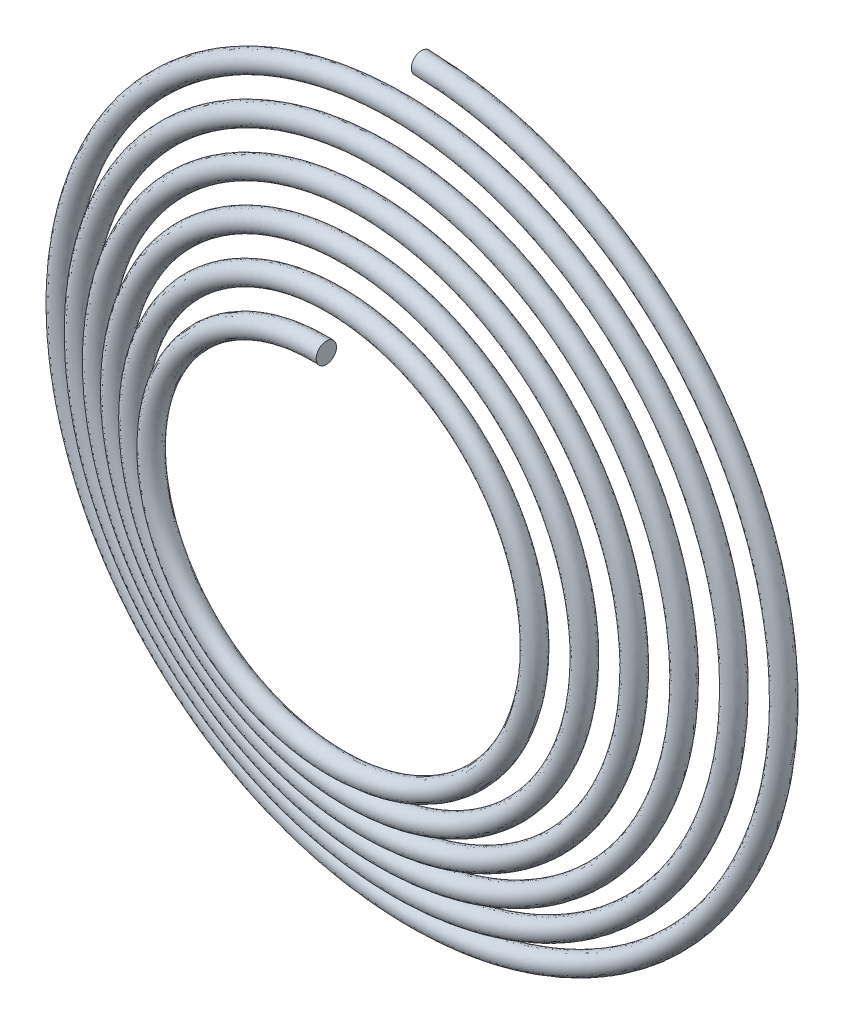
ISO-10303-21;
HEADER;
FILE_DESCRIPTION(('STEP AP214'),'2;1');
FILE_NAME('part.step','',(''),(''),'','','');
FILE_SCHEMA(('AUTOMOTIVE_DESIGN { 1 0 10303 214 1 1 1 1 }'));
ENDSEC;
DATA;
#1=APPLICATION_CONTEXT('core data for automotive mechanical design processes');
#2=APPLICATION_PROTOCOL_DEFINITION('international standard','automotive_design',2000,#1);
#3=PRODUCT_CONTEXT('',#1,'mechanical');
#4=PRODUCT('Part','Part','',(#3));
#5=PRODUCT_RELATED_PRODUCT_CATEGORY('part','',(#4));
#6=PRODUCT_DEFINITION_FORMATION('','',#4);
#7=PRODUCT_DEFINITION_CONTEXT('part definition',#1,'design');
#8=PRODUCT_DEFINITION('design','',#6,#7);
#9=PRODUCT_DEFINITION_SHAPE('','',#8);
#10=(LENGTH_UNIT() NAMED_UNIT(*) SI_UNIT(.MILLI.,.METRE.));
#11=(NAMED_UNIT(*) PLANE_ANGLE_UNIT() SI_UNIT($,.RADIAN.));
#12=(NAMED_UNIT(*) SI_UNIT($,.STERADIAN.) SOLID_ANGLE_UNIT());
#13=UNCERTAINTY_MEASURE_WITH_UNIT(LENGTH_MEASURE(1.E-05),#10,'distance_accuracy_value','');
#14=(GEOMETRIC_REPRESENTATION_CONTEXT(3) GLOBAL_UNCERTAINTY_ASSIGNED_CONTEXT((#13)) GLOBAL_UNIT_ASSIGNED_CONTEXT((#10,
#11,#12)) REPRESENTATION_CONTEXT('',''));
#15=CARTESIAN_POINT('',(0.,0.,0.));
#16=DIRECTION('',(0.,0.,1.));
#17=DIRECTION('',(1.,0.,0.));
#18=AXIS2_PLACEMENT_3D('',#15,#16,#17);
#19=CARTESIAN_POINT('',(0.,5.51404853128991,0.));
#20=DIRECTION('',(1.,0.,0.));
#21=DIRECTION('',(0.,0.,-1.));
#22=AXIS2_PLACEMENT_3D('',#19,#20,#21);
#23=PLANE('',#22);
#24=CARTESIAN_POINT('',(0.,5.51404853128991,0.));
#25=DIRECTION('',(1.,0.,0.));
#26=DIRECTION('',(0.,0.,-1.));
#27=AXIS2_PLACEMENT_3D('',#24,#25,#26);
#28=CIRCLE('',#27,0.15);
#29=CARTESIAN_POINT('',(0.,5.51404853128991,-0.15));
#30=VERTEX_POINT('',#29);
#31=EDGE_CURVE('E43',#30,#30,#28,.T.);
#32=ORIENTED_EDGE('',*,*,#31,.F.);
#33=EDGE_LOOP('',(#32));
#34=FACE_BOUND('',#33,.T.);
#35=ADVANCED_FACE('F33',(#34),#23,.F.);
#36=CARTESIAN_POINT('',(2.20906192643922E-13,2.51173884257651,1.4));
#37=DIRECTION('',(1.,0.,0.));
#38=DIRECTION('',(0.,0.,-1.));
#39=AXIS2_PLACEMENT_3D('',#36,#37,#38);
#40=PLANE('',#39);
#41=CARTESIAN_POINT('',(2.20906192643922E-13,2.51173884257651,1.4));
#42=DIRECTION('',(1.,0.,0.));
#43=DIRECTION('',(0.,0.,-1.));
#44=AXIS2_PLACEMENT_3D('',#41,#42,#43);
#45=CIRCLE('',#44,0.15);
#46=CARTESIAN_POINT('',(2.20797772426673E-13,2.51173884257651,1.25));
#47=VERTEX_POINT('',#46);
#48=EDGE_CURVE('E11',#47,#47,#45,.T.);
#49=ORIENTED_EDGE('',*,*,#48,.T.);
#50=EDGE_LOOP('',(#49));
#51=FACE_BOUND('',#50,.T.);
#52=ADVANCED_FACE('F50',(#51),#40,.T.);
#53=CARTESIAN_POINT('',(0.,5.51404853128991,-0.15));
#54=CARTESIAN_POINT('',(1.0829422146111,5.49839488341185,-0.142708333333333));
#55=CARTESIAN_POINT('',(2.15361338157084,5.15507151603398,-0.135416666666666));
#56=CARTESIAN_POINT('',(3.92114426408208,3.93644578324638,-0.120833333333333));
#57=CARTESIAN_POINT('',(4.61485263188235,3.06334093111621,-0.113541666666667));
#58=CARTESIAN_POINT('',(5.40041974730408,1.08512071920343,-0.0989583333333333));
#59=CARTESIAN_POINT('',(5.491204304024,-0.0166808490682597,-0.0916666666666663));
#60=CARTESIAN_POINT('',(5.04893273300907,-2.07988276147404,-0.0770833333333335));
#61=CARTESIAN_POINT('',(4.51681862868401,-3.0379604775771,-0.0697916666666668));
#62=CARTESIAN_POINT('',(3.01585439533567,-4.49471254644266,-0.0552083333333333));
#63=CARTESIAN_POINT('',(2.04961223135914,-4.99116884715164,-0.0479166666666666));
#64=CARTESIAN_POINT('',(0.0103437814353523,-5.36492936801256,-0.0333333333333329));
#65=CARTESIAN_POINT('',(-1.05931125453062,-5.24184411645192,-0.0260416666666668));
#66=CARTESIAN_POINT('',(-2.94553362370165,-4.42670670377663,-0.0114583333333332));
#67=CARTESIAN_POINT('',(-3.75910925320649,-3.73619217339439,-0.00416666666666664));
#68=CARTESIAN_POINT('',(-4.86434630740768,-2.02581661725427,0.0104166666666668));
#69=CARTESIAN_POINT('',(-5.1543911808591,-1.00887119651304,0.0177083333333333));
#70=CARTESIAN_POINT('',(-5.12312845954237,1.00887119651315,0.0322916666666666));
#71=CARTESIAN_POINT('',(-4.80209657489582,2.00637587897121,0.0395833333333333));
#72=CARTESIAN_POINT('',(-3.6653384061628,3.65138329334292,0.0541666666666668));
#73=CARTESIAN_POINT('',(-2.85165376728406,4.29632675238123,0.0614583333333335));
#74=CARTESIAN_POINT('',(-1.00957433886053,5.02550250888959,0.0760416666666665));
#75=CARTESIAN_POINT('',(0.0157287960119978,5.10875262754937,0.0833333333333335));
#76=CARTESIAN_POINT('',(1.9344044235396,4.69522912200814,0.0979166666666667));
#77=CARTESIAN_POINT('',(2.82469010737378,4.19935061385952,0.105208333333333));
#78=CARTESIAN_POINT('',(4.17724453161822,2.80258402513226,0.119791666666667));
#79=CARTESIAN_POINT('',(4.63746523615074,1.9041338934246,0.127083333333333));
#80=CARTESIAN_POINT('',(4.98247769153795,0.00939172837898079,0.141666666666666));
#81=CARTESIAN_POINT('',(4.8669268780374,-0.983764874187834,0.148958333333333));
#82=CARTESIAN_POINT('',(4.10818082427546,-2.73384645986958,0.163541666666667));
#83=CARTESIAN_POINT('',(3.46643120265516,-3.48800187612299,0.170833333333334));
#84=CARTESIAN_POINT('',(1.87857911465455,-4.51137136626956,0.185416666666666));
#85=CARTESIAN_POINT('',(0.935192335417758,-4.77910246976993,0.192708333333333));
#86=CARTESIAN_POINT('',(-0.935192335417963,-4.74783974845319,0.207291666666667));
#87=CARTESIAN_POINT('',(-1.85913837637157,-4.44912163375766,0.214583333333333));
#88=CARTESIAN_POINT('',(-3.38162232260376,-3.39423102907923,0.229166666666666));
#89=CARTESIAN_POINT('',(-3.97780087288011,-2.63996660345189,0.236458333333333));
#90=CARTESIAN_POINT('',(-4.65058527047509,-0.934027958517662,0.251041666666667));
#91=CARTESIAN_POINT('',(-4.72630095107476,0.014776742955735,0.258333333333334));
#92=CARTESIAN_POINT('',(-4.34152551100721,1.78892608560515,0.272916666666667));
#93=CARTESIAN_POINT('',(-3.88188259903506,2.61141973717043,0.280208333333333));
#94=CARTESIAN_POINT('',(-2.58931365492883,3.85977651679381,0.294791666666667));
#95=CARTESIAN_POINT('',(-1.75865555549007,4.28376162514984,0.302083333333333));
#96=CARTESIAN_POINT('',(-0.00843967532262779,4.60002601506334,0.316666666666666));
#97=CARTESIAN_POINT('',(0.90821849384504,4.49200963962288,0.323958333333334));
#98=CARTESIAN_POINT('',(2.52215929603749,3.78965494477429,0.338541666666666));
#99=CARTESIAN_POINT('',(3.21689449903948,3.19667023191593,0.345833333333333));
#100=CARTESIAN_POINT('',(4.15839642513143,1.73134161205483,0.360416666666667));
#101=CARTESIAN_POINT('',(4.40381375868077,0.861513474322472,0.367708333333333));
#102=CARTESIAN_POINT('',(4.37255103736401,-0.861513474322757,0.382291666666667));
#103=CARTESIAN_POINT('',(4.09614669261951,-1.71190087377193,0.389583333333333));
#104=CARTESIAN_POINT('',(3.12312365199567,-3.11186135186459,0.404166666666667));
#105=CARTESIAN_POINT('',(2.42827943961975,-3.65927499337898,0.411458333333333));
#106=CARTESIAN_POINT('',(0.858481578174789,-4.27566803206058,0.426041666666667));
#107=CARTESIAN_POINT('',(-0.013824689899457,-4.34384927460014,0.433333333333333));
#108=CARTESIAN_POINT('',(-1.64344774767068,-3.98782190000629,0.447916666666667));
#109=CARTESIAN_POINT('',(-2.39814936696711,-3.56441458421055,0.455208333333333));
#110=CARTESIAN_POINT('',(-3.54230850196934,-2.37604328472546,0.469791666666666));
#111=CARTESIAN_POINT('',(-3.93005801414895,-1.61317721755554,0.477083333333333));
#112=CARTESIAN_POINT('',(-4.21757433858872,-0.00748762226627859,0.491666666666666));
#113=CARTESIAN_POINT('',(-4.11709240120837,0.832672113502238,0.498958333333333));
#114=CARTESIAN_POINT('',(-3.47112906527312,2.31047213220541,0.513541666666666));
#115=CARTESIAN_POINT('',(-2.92690926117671,2.94578712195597,0.520833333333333));
#116=CARTESIAN_POINT('',(-1.58410410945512,3.8054214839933,0.535416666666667));
#117=CARTESIAN_POINT('',(-0.787834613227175,4.0285250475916,0.542708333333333));
#118=CARTESIAN_POINT('',(0.787834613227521,3.99726232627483,0.557291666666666));
#119=CARTESIAN_POINT('',(1.56466337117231,3.74317175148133,0.564583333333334));
#120=CARTESIAN_POINT('',(2.84210038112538,2.85201627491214,0.579166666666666));
#121=CARTESIAN_POINT('',(3.34074911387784,2.21659227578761,0.586458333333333));
#122=CARTESIAN_POINT('',(3.90075079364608,0.782935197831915,0.601041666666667));
#123=CARTESIAN_POINT('',(3.96139759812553,-0.0128726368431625,0.608333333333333));
#124=CARTESIAN_POINT('',(3.63411828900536,-1.49796940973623,0.622916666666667));
#125=CARTESIAN_POINT('',(3.24694656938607,-2.18487899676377,0.630208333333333));
#126=CARTESIAN_POINT('',(2.16277291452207,-3.2248404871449,0.644791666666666));
#127=CARTESIAN_POINT('',(1.46769887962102,-3.57635440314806,0.652083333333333));
#128=CARTESIAN_POINT('',(0.00653556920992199,-3.8351226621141,0.666666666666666));
#129=CARTESIAN_POINT('',(-0.757125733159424,-3.74217516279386,0.673958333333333));
#130=CARTESIAN_POINT('',(-2.09878496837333,-3.15260318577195,0.688541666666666));
#131=CARTESIAN_POINT('',(-2.67467974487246,-2.6571482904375,0.695833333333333));
#132=CARTESIAN_POINT('',(-3.45244654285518,-1.4368666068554,0.710416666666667));
#133=CARTESIAN_POINT('',(-3.65323633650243,-0.714155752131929,0.717708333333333));
#134=CARTESIAN_POINT('',(-3.62197361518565,0.714155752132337,0.732291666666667));
#135=CARTESIAN_POINT('',(-3.39019681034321,1.4174258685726,0.739583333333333));
#136=CARTESIAN_POINT('',(-2.58090889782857,2.57233941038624,0.754166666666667));
#137=CARTESIAN_POINT('',(-2.00490511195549,3.0222232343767,0.761458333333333));
#138=CARTESIAN_POINT('',(-0.707388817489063,3.52583355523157,0.776041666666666));
#139=CARTESIAN_POINT('',(0.0119205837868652,3.57894592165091,0.783333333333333));
#140=CARTESIAN_POINT('',(1.35249107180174,3.28041467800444,0.797916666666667));
#141=CARTESIAN_POINT('',(1.97160862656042,2.9294785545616,0.805208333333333));
#142=CARTESIAN_POINT('',(2.90737247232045,1.94950254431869,0.819791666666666));
#143=CARTESIAN_POINT('',(3.22265079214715,1.32222054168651,0.827083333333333));
#144=CARTESIAN_POINT('',(3.45267098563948,0.00558351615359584,0.841666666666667));
#145=CARTESIAN_POINT('',(3.36725792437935,-0.681579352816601,0.848958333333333));
#146=CARTESIAN_POINT('',(2.83407730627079,-1.88709780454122,0.863541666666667));
#147=CARTESIAN_POINT('',(2.38738731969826,-2.40357236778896,0.870833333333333));
#148=CARTESIAN_POINT('',(1.28962910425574,-3.09947160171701,0.885416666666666));
#149=CARTESIAN_POINT('',(0.640476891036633,-3.27794762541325,0.892708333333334));
#150=CARTESIAN_POINT('',(-0.640476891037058,-3.24668490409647,0.907291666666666));
#151=CARTESIAN_POINT('',(-1.27018836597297,-3.03722186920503,0.914583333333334));
#152=CARTESIAN_POINT('',(-2.30257843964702,-2.30980152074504,0.929166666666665));
#153=CARTESIAN_POINT('',(-2.70369735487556,-1.79321794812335,0.936458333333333));
#154=CARTESIAN_POINT('',(-3.15091631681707,-0.631842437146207,0.951041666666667));
#155=CARTESIAN_POINT('',(-3.1964942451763,0.0109685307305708,0.958333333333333));
#156=CARTESIAN_POINT('',(-2.92671106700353,1.20701273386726,0.972916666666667));
#157=CARTESIAN_POINT('',(-2.61201053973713,1.75833825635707,0.980208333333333));
#158=CARTESIAN_POINT('',(-1.73623217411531,2.58990445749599,0.994791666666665));
#159=CARTESIAN_POINT('',(-1.176742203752,2.86894718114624,1.00208333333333));
#160=CARTESIAN_POINT('',(-0.00463146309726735,3.07021930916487,1.01666666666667));
#161=CARTESIAN_POINT('',(0.606032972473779,2.99234068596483,1.02395833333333));
#162=CARTESIAN_POINT('',(1.67541064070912,2.51555142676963,1.03854166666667));
#163=CARTESIAN_POINT('',(2.13246499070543,2.11762634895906,1.04583333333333));
#164=CARTESIAN_POINT('',(2.74649666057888,1.14239160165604,1.06041666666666));
#165=CARTESIAN_POINT('',(2.90265891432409,0.566798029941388,1.06770833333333));
#166=CARTESIAN_POINT('',(2.87139619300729,-0.566798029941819,1.08229166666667));
#167=CARTESIAN_POINT('',(2.68424692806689,-1.12295086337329,1.08958333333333));
#168=CARTESIAN_POINT('',(2.0386941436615,-2.03281746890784,1.10416666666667));
#169=CARTESIAN_POINT('',(1.58153078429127,-2.3851714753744,1.11145833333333));
#170=CARTESIAN_POINT('',(0.556296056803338,-2.77599907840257,1.12604166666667));
#171=CARTESIAN_POINT('',(-0.0100164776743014,-2.81404256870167,1.13333333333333));
#172=CARTESIAN_POINT('',(-1.06153439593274,-2.57300745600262,1.14791666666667));
#173=CARTESIAN_POINT('',(-1.54506788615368,-2.29454252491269,1.15520833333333));
#174=CARTESIAN_POINT('',(-2.27243644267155,-1.52296180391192,1.16979166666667));
#175=CARTESIAN_POINT('',(-2.51524357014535,-1.03126386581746,1.17708333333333));
#176=CARTESIAN_POINT('',(-2.68776763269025,-0.00367941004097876,1.19166666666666));
#177=CARTESIAN_POINT('',(-2.61742344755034,0.53048659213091,1.19895833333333));
#178=CARTESIAN_POINT('',(-2.19702554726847,1.46372347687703,1.21354166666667));
#179=CARTESIAN_POINT('',(-1.84786537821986,1.8613576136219,1.22083333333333));
#180=CARTESIAN_POINT('',(-0.995154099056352,2.39352171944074,1.23541666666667));
#181=CARTESIAN_POINT('',(-0.493298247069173,2.52738479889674,1.24270833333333));
#182=CARTESIAN_POINT('',(2.20797772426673E-13,2.51173884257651,1.25));
#183=CARTESIAN_POINT('',(0.,5.81404853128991,-0.15));
#184=CARTESIAN_POINT('',(1.14186131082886,5.7983945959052,-0.142708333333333));
#185=CARTESIAN_POINT('',(2.27131276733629,5.43723423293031,-0.135416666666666));
#186=CARTESIAN_POINT('',(4.13678701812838,4.15316483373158,-0.120833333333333));
#187=CARTESIAN_POINT('',(4.86947730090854,3.23256038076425,-0.113541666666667));
#188=CARTESIAN_POINT('',(5.70012279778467,1.14551132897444,-0.0989583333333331));
#189=CARTESIAN_POINT('',(5.79693026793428,-0.0174419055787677,-0.0916666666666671));
#190=CARTESIAN_POINT('',(5.33167793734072,-2.19617589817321,-0.0770833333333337));
#191=CARTESIAN_POINT('',(4.77059765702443,-3.20844551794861,-0.0697916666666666));
#192=CARTESIAN_POINT('',(3.18633943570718,-4.74849157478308,-0.0552083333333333));
#193=CARTESIAN_POINT('',(2.1659053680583,-5.27391405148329,-0.0479166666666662));
#194=CARTESIAN_POINT('',(0.0111048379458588,-5.67065533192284,-0.0333333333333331));
#195=CARTESIAN_POINT('',(-1.11970186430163,-5.54154716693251,-0.0260416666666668));
#196=CARTESIAN_POINT('',(-3.1147530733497,-4.68133137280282,-0.0114583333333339));
#197=CARTESIAN_POINT('',(-3.97582830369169,-3.9518349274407,-0.00416666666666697));
#198=CARTESIAN_POINT('',(-5.14650902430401,-2.14351600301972,0.0104166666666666));
#199=CARTESIAN_POINT('',(-5.4543911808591,-1.06776894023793,0.0177083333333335));
#200=CARTESIAN_POINT('',(-5.42312845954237,1.06776894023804,0.0322916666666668));
#201=CARTESIAN_POINT('',(-5.08425929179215,2.12407526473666,0.0395833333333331));
#202=CARTESIAN_POINT('',(-3.882057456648,3.86702604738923,0.054166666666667));
#203=CARTESIAN_POINT('',(-3.0208732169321,4.55095142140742,0.0614583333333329));
#204=CARTESIAN_POINT('',(-1.06996494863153,5.32520555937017,0.0760416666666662));
#205=CARTESIAN_POINT('',(0.0164898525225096,5.41447859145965,0.0833333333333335));
#206=CARTESIAN_POINT('',(2.05069756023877,4.97797432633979,0.0979166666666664));
#207=CARTESIAN_POINT('',(2.99517514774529,4.45312964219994,0.105208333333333));
#208=CARTESIAN_POINT('',(4.43102355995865,2.97306906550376,0.119791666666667));
#209=CARTESIAN_POINT('',(4.9202104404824,2.02042703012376,0.127083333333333));
#210=CARTESIAN_POINT('',(5.28820365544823,0.0101527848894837,0.141666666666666));
#211=CARTESIAN_POINT('',(5.16662992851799,-1.04415548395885,0.148958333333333));
#212=CARTESIAN_POINT('',(4.36280549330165,-2.90306590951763,0.163541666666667));
#213=CARTESIAN_POINT('',(3.68207395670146,-3.70472092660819,0.170833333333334));
#214=CARTESIAN_POINT('',(1.99627850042,-4.79353408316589,0.185416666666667));
#215=CARTESIAN_POINT('',(0.994090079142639,-5.07910246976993,0.192708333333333));
#216=CARTESIAN_POINT('',(-0.994090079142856,-5.04783974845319,0.207291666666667));
#217=CARTESIAN_POINT('',(-1.97683776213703,-4.73128435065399,0.214583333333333));
#218=CARTESIAN_POINT('',(-3.59726507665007,-3.61095007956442,0.229166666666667));
#219=CARTESIAN_POINT('',(-4.2324255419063,-2.80918605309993,0.236458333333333));
#220=CARTESIAN_POINT('',(-4.95028832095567,-0.994418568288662,0.251041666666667));
#221=CARTESIAN_POINT('',(-5.03202691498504,0.0155377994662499,0.258333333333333));
#222=CARTESIAN_POINT('',(-4.62427071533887,1.90521922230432,0.272916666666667));
#223=CARTESIAN_POINT('',(-4.13566162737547,2.78190477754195,0.280208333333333));
#224=CARTESIAN_POINT('',(-2.75979869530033,4.11355554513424,0.294791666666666));
#225=CARTESIAN_POINT('',(-1.87494869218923,4.56650682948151,0.302083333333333));
#226=CARTESIAN_POINT('',(-0.00920073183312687,4.90575197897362,0.316666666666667));
#227=CARTESIAN_POINT('',(0.968609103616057,4.79171269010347,0.323958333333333));
#228=CARTESIAN_POINT('',(2.69137874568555,4.04427961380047,0.338541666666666));
#229=CARTESIAN_POINT('',(3.43361354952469,3.41231298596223,0.345833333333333));
#230=CARTESIAN_POINT('',(4.44055914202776,1.84904099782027,0.360416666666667));
#231=CARTESIAN_POINT('',(4.70381375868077,0.92041121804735,0.367708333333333));
#232=CARTESIAN_POINT('',(4.67255103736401,-0.920411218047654,0.382291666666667));
#233=CARTESIAN_POINT('',(4.37830940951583,-1.82960025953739,0.389583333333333));
#234=CARTESIAN_POINT('',(3.33984270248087,-3.3275041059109,0.404166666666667));
#235=CARTESIAN_POINT('',(2.59749888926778,-3.91389966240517,0.411458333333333));
#236=CARTESIAN_POINT('',(0.918872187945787,-4.57537108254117,0.426041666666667));
#237=CARTESIAN_POINT('',(-0.0145857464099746,-4.64957523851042,0.433333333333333));
#238=CARTESIAN_POINT('',(-1.75974088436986,-4.27056710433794,0.447916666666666));
#239=CARTESIAN_POINT('',(-2.56863440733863,-3.81819361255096,0.455208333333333));
#240=CARTESIAN_POINT('',(-3.79608753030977,-2.54652832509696,0.469791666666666));
#241=CARTESIAN_POINT('',(-4.21280321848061,-1.7294703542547,0.477083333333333));
#242=CARTESIAN_POINT('',(-4.523300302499,-0.0082486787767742,0.491666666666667));
#243=CARTESIAN_POINT('',(-4.41679545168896,0.893062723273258,0.498958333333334));
#244=CARTESIAN_POINT('',(-3.7257537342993,2.47969158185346,0.513541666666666));
#245=CARTESIAN_POINT('',(-3.14255201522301,3.16250617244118,0.520833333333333));
#246=CARTESIAN_POINT('',(-1.70180349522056,4.08758420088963,0.535416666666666));
#247=CARTESIAN_POINT('',(-0.846732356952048,4.3285250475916,0.542708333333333));
#248=CARTESIAN_POINT('',(0.84673235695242,4.29726232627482,0.557291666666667));
#249=CARTESIAN_POINT('',(1.68236275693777,4.02533446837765,0.564583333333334));
#250=CARTESIAN_POINT('',(3.05774313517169,3.06873532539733,0.579166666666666));
#251=CARTESIAN_POINT('',(3.59537378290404,2.38581172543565,0.586458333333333));
#252=CARTESIAN_POINT('',(4.20045384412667,0.843325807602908,0.601041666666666));
#253=CARTESIAN_POINT('',(4.26712356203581,-0.013633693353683,0.608333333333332));
#254=CARTESIAN_POINT('',(3.91686349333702,-1.61426254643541,0.622916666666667));
#255=CARTESIAN_POINT('',(3.50072559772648,-2.35536403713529,0.630208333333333));
#256=CARTESIAN_POINT('',(2.33325795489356,-3.47861951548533,0.644791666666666));
#257=CARTESIAN_POINT('',(1.58399201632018,-3.85909960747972,0.652083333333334));
#258=CARTESIAN_POINT('',(0.00729662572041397,-4.14084862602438,0.666666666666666));
#259=CARTESIAN_POINT('',(-0.817516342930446,-4.04187821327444,0.673958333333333));
#260=CARTESIAN_POINT('',(-2.26800441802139,-3.40722785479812,0.688541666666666));
#261=CARTESIAN_POINT('',(-2.89139879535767,-2.8727910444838,0.695833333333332));
#262=CARTESIAN_POINT('',(-3.73460925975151,-1.55456599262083,0.710416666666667));
#263=CARTESIAN_POINT('',(-3.95323633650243,-0.773053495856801,0.717708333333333));
#264=CARTESIAN_POINT('',(-3.92197361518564,0.77305349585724,0.732291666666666));
#265=CARTESIAN_POINT('',(-3.67235952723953,1.53512525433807,0.739583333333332));
#266=CARTESIAN_POINT('',(-2.79762794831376,2.78798216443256,0.754166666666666));
#267=CARTESIAN_POINT('',(-2.17412456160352,3.2768479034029,0.761458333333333));
#268=CARTESIAN_POINT('',(-0.767779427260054,3.82553660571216,0.776041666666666));
#269=CARTESIAN_POINT('',(0.0126816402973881,3.8846718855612,0.783333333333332));
#270=CARTESIAN_POINT('',(1.46878420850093,3.5631598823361,0.797916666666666));
#271=CARTESIAN_POINT('',(2.14209366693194,3.18325758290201,0.805208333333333));
#272=CARTESIAN_POINT('',(3.16115150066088,2.11998758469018,0.819791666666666));
#273=CARTESIAN_POINT('',(3.50539599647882,1.43851367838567,0.827083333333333));
#274=CARTESIAN_POINT('',(3.75839694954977,0.00634457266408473,0.841666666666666));
#275=CARTESIAN_POINT('',(3.66696097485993,-0.741969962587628,0.848958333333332));
#276=CARTESIAN_POINT('',(3.08870197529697,-2.05631725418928,0.863541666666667));
#277=CARTESIAN_POINT('',(2.60303007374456,-2.62029141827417,0.870833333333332));
#278=CARTESIAN_POINT('',(1.40732849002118,-3.38163431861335,0.885416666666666));
#279=CARTESIAN_POINT('',(0.699374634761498,-3.57794762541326,0.892708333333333));
#280=CARTESIAN_POINT('',(-0.69937463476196,-3.54668490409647,0.907291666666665));
#281=CARTESIAN_POINT('',(-1.38788775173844,-3.31938458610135,0.914583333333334));
#282=CARTESIAN_POINT('',(-2.51822119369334,-2.52652057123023,0.929166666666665));
#283=CARTESIAN_POINT('',(-2.95832202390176,-1.96243739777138,0.936458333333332));
#284=CARTESIAN_POINT('',(-3.45061936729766,-0.692233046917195,0.951041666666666));
#285=CARTESIAN_POINT('',(-3.50222020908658,0.0117295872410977,0.958333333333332));
#286=CARTESIAN_POINT('',(-3.20945627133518,1.32330587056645,0.972916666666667));
#287=CARTESIAN_POINT('',(-2.86578956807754,1.92882329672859,0.980208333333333));
#288=CARTESIAN_POINT('',(-1.9067172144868,2.84368348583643,0.994791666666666));
#289=CARTESIAN_POINT('',(-1.29303534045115,3.15169238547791,1.00208333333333));
#290=CARTESIAN_POINT('',(-0.00539251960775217,3.37594527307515,1.01666666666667));
#291=CARTESIAN_POINT('',(0.666423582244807,3.29204373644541,1.02395833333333));
#292=CARTESIAN_POINT('',(1.84463009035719,2.7701760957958,1.03854166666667));
#293=CARTESIAN_POINT('',(2.34918404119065,2.33326910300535,1.04583333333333));
#294=CARTESIAN_POINT('',(3.02865937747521,1.26009098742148,1.06041666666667));
#295=CARTESIAN_POINT('',(3.20265891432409,0.62569577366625,1.06770833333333));
#296=CARTESIAN_POINT('',(3.17139619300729,-0.625695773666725,1.08229166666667));
#297=CARTESIAN_POINT('',(2.9664096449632,-1.24065024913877,1.08958333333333));
#298=CARTESIAN_POINT('',(2.25541319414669,-2.24846022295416,1.10416666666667));
#299=CARTESIAN_POINT('',(1.7507502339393,-2.6397961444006,1.11145833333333));
#300=CARTESIAN_POINT('',(0.616686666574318,-3.07570212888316,1.12604166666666));
#301=CARTESIAN_POINT('',(-0.0107775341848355,-3.11976853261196,1.13333333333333));
#302=CARTESIAN_POINT('',(-1.17782753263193,-2.85575266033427,1.14791666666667));
#303=CARTESIAN_POINT('',(-1.7155529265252,-2.5483215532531,1.15520833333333));
#304=CARTESIAN_POINT('',(-2.52621547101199,-1.69344684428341,1.16979166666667));
#305=CARTESIAN_POINT('',(-2.79798877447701,-1.14755700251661,1.17708333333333));
#306=CARTESIAN_POINT('',(-2.99349359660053,-0.00444046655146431,1.19166666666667));
#307=CARTESIAN_POINT('',(-2.91712649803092,0.590877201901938,1.19895833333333));
#308=CARTESIAN_POINT('',(-2.45165021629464,1.6329429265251,1.21354166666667));
#309=CARTESIAN_POINT('',(-2.06350813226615,2.07807666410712,1.22083333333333));
#310=CARTESIAN_POINT('',(-1.11285348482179,2.67568443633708,1.23541666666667));
#311=CARTESIAN_POINT('',(-0.55221734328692,2.82738451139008,1.24270833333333));
#312=CARTESIAN_POINT('',(2.45846230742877E-13,2.81173884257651,1.25));
#313=CARTESIAN_POINT('',(0.,5.81404853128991,0.15));
#314=CARTESIAN_POINT('',(1.14186131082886,5.79839459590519,0.157291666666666));
#315=CARTESIAN_POINT('',(2.27131276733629,5.43723423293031,0.164583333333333));
#316=CARTESIAN_POINT('',(4.13678701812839,4.15316483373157,0.179166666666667));
#317=CARTESIAN_POINT('',(4.86947730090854,3.23256038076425,0.186458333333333));
#318=CARTESIAN_POINT('',(5.70012279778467,1.14551132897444,0.201041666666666));
#319=CARTESIAN_POINT('',(5.79693026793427,-0.0174419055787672,0.208333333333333));
#320=CARTESIAN_POINT('',(5.33167793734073,-2.19617589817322,0.222916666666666));
#321=CARTESIAN_POINT('',(4.77059765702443,-3.20844551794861,0.230208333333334));
#322=CARTESIAN_POINT('',(3.18633943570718,-4.74849157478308,0.244791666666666));
#323=CARTESIAN_POINT('',(2.1659053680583,-5.27391405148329,0.252083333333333));
#324=CARTESIAN_POINT('',(0.0111048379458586,-5.67065533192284,0.266666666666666));
#325=CARTESIAN_POINT('',(-1.11970186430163,-5.54154716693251,0.273958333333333));
#326=CARTESIAN_POINT('',(-3.1147530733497,-4.68133137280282,0.288541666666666));
#327=CARTESIAN_POINT('',(-3.97582830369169,-3.9518349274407,0.295833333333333));
#328=CARTESIAN_POINT('',(-5.14650902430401,-2.14351600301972,0.310416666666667));
#329=CARTESIAN_POINT('',(-5.4543911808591,-1.06776894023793,0.317708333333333));
#330=CARTESIAN_POINT('',(-5.42312845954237,1.06776894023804,0.332291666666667));
#331=CARTESIAN_POINT('',(-5.08425929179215,2.12407526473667,0.339583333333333));
#332=CARTESIAN_POINT('',(-3.882057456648,3.86702604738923,0.354166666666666));
#333=CARTESIAN_POINT('',(-3.0208732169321,4.55095142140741,0.361458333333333));
#334=CARTESIAN_POINT('',(-1.06996494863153,5.32520555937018,0.376041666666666));
#335=CARTESIAN_POINT('',(0.0164898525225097,5.41447859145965,0.383333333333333));
#336=CARTESIAN_POINT('',(2.05069756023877,4.97797432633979,0.397916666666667));
#337=CARTESIAN_POINT('',(2.99517514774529,4.45312964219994,0.405208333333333));
#338=CARTESIAN_POINT('',(4.43102355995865,2.97306906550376,0.419791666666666));
#339=CARTESIAN_POINT('',(4.9202104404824,2.02042703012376,0.427083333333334));
#340=CARTESIAN_POINT('',(5.28820365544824,0.0101527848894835,0.441666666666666));
#341=CARTESIAN_POINT('',(5.16662992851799,-1.04415548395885,0.448958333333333));
#342=CARTESIAN_POINT('',(4.36280549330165,-2.90306590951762,0.463541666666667));
#343=CARTESIAN_POINT('',(3.68207395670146,-3.70472092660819,0.470833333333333));
#344=CARTESIAN_POINT('',(1.99627850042,-4.79353408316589,0.485416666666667));
#345=CARTESIAN_POINT('',(0.994090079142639,-5.07910246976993,0.492708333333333));
#346=CARTESIAN_POINT('',(-0.994090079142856,-5.04783974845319,0.507291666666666));
#347=CARTESIAN_POINT('',(-1.97683776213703,-4.73128435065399,0.514583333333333));
#348=CARTESIAN_POINT('',(-3.59726507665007,-3.61095007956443,0.529166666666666));
#349=CARTESIAN_POINT('',(-4.23242554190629,-2.80918605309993,0.536458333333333));
#350=CARTESIAN_POINT('',(-4.95028832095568,-0.994418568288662,0.551041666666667));
#351=CARTESIAN_POINT('',(-5.03202691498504,0.0155377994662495,0.558333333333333));
#352=CARTESIAN_POINT('',(-4.62427071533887,1.90521922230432,0.572916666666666));
#353=CARTESIAN_POINT('',(-4.13566162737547,2.78190477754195,0.580208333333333));
#354=CARTESIAN_POINT('',(-2.75979869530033,4.11355554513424,0.594791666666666));
#355=CARTESIAN_POINT('',(-1.87494869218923,4.56650682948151,0.602083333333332));
#356=CARTESIAN_POINT('',(-0.00920073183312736,4.90575197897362,0.616666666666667));
#357=CARTESIAN_POINT('',(0.968609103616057,4.79171269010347,0.623958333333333));
#358=CARTESIAN_POINT('',(2.69137874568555,4.04427961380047,0.638541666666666));
#359=CARTESIAN_POINT('',(3.43361354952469,3.41231298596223,0.645833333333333));
#360=CARTESIAN_POINT('',(4.44055914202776,1.84904099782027,0.660416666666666));
#361=CARTESIAN_POINT('',(4.70381375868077,0.920411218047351,0.667708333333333));
#362=CARTESIAN_POINT('',(4.67255103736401,-0.920411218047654,0.682291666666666));
#363=CARTESIAN_POINT('',(4.37830940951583,-1.82960025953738,0.689583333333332));
#364=CARTESIAN_POINT('',(3.33984270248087,-3.32750410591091,0.704166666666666));
#365=CARTESIAN_POINT('',(2.59749888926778,-3.91389966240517,0.711458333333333));
#366=CARTESIAN_POINT('',(0.918872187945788,-4.57537108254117,0.726041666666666));
#367=CARTESIAN_POINT('',(-0.014585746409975,-4.64957523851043,0.733333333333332));
#368=CARTESIAN_POINT('',(-1.75974088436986,-4.27056710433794,0.747916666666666));
#369=CARTESIAN_POINT('',(-2.56863440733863,-3.81819361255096,0.755208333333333));
#370=CARTESIAN_POINT('',(-3.79608753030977,-2.54652832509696,0.769791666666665));
#371=CARTESIAN_POINT('',(-4.21280321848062,-1.7294703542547,0.777083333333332));
#372=CARTESIAN_POINT('',(-4.523300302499,-0.00824867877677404,0.791666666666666));
#373=CARTESIAN_POINT('',(-4.41679545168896,0.893062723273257,0.798958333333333));
#374=CARTESIAN_POINT('',(-3.7257537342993,2.47969158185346,0.813541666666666));
#375=CARTESIAN_POINT('',(-3.14255201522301,3.16250617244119,0.820833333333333));
#376=CARTESIAN_POINT('',(-1.70180349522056,4.08758420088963,0.835416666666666));
#377=CARTESIAN_POINT('',(-0.846732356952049,4.3285250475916,0.842708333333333));
#378=CARTESIAN_POINT('',(0.84673235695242,4.29726232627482,0.857291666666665));
#379=CARTESIAN_POINT('',(1.68236275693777,4.02533446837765,0.864583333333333));
#380=CARTESIAN_POINT('',(3.0577431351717,3.06873532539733,0.879166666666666));
#381=CARTESIAN_POINT('',(3.59537378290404,2.38581172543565,0.886458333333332));
#382=CARTESIAN_POINT('',(4.20045384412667,0.843325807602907,0.901041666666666));
#383=CARTESIAN_POINT('',(4.26712356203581,-0.0136336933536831,0.908333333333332));
#384=CARTESIAN_POINT('',(3.91686349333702,-1.61426254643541,0.922916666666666));
#385=CARTESIAN_POINT('',(3.50072559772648,-2.35536403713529,0.930208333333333));
#386=CARTESIAN_POINT('',(2.33325795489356,-3.47861951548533,0.944791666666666));
#387=CARTESIAN_POINT('',(1.58399201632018,-3.85909960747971,0.952083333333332));
#388=CARTESIAN_POINT('',(0.00729662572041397,-4.14084862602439,0.966666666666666));
#389=CARTESIAN_POINT('',(-0.817516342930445,-4.04187821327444,0.973958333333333));
#390=CARTESIAN_POINT('',(-2.26800441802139,-3.40722785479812,0.988541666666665));
#391=CARTESIAN_POINT('',(-2.89139879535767,-2.8727910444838,0.995833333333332));
#392=CARTESIAN_POINT('',(-3.73460925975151,-1.55456599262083,1.01041666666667));
#393=CARTESIAN_POINT('',(-3.95323633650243,-0.773053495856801,1.01770833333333));
#394=CARTESIAN_POINT('',(-3.92197361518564,0.773053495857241,1.03229166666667));
#395=CARTESIAN_POINT('',(-3.67235952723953,1.53512525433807,1.03958333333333));
#396=CARTESIAN_POINT('',(-2.79762794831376,2.78798216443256,1.05416666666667));
#397=CARTESIAN_POINT('',(-2.17412456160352,3.2768479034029,1.06145833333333));
#398=CARTESIAN_POINT('',(-0.767779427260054,3.82553660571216,1.07604166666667));
#399=CARTESIAN_POINT('',(0.0126816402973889,3.88467188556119,1.08333333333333));
#400=CARTESIAN_POINT('',(1.46878420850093,3.5631598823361,1.09791666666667));
#401=CARTESIAN_POINT('',(2.14209366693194,3.18325758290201,1.10520833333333));
#402=CARTESIAN_POINT('',(3.16115150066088,2.11998758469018,1.11979166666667));
#403=CARTESIAN_POINT('',(3.50539599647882,1.43851367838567,1.12708333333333));
#404=CARTESIAN_POINT('',(3.75839694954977,0.00634457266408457,1.14166666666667));
#405=CARTESIAN_POINT('',(3.66696097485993,-0.741969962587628,1.14895833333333));
#406=CARTESIAN_POINT('',(3.08870197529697,-2.05631725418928,1.16354166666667));
#407=CARTESIAN_POINT('',(2.60303007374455,-2.62029141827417,1.17083333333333));
#408=CARTESIAN_POINT('',(1.40732849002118,-3.38163431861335,1.18541666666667));
#409=CARTESIAN_POINT('',(0.699374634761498,-3.57794762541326,1.19270833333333));
#410=CARTESIAN_POINT('',(-0.69937463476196,-3.54668490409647,1.20729166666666));
#411=CARTESIAN_POINT('',(-1.38788775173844,-3.31938458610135,1.21458333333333));
#412=CARTESIAN_POINT('',(-2.51822119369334,-2.52652057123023,1.22916666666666));
#413=CARTESIAN_POINT('',(-2.95832202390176,-1.96243739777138,1.23645833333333));
#414=CARTESIAN_POINT('',(-3.45061936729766,-0.692233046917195,1.25104166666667));
#415=CARTESIAN_POINT('',(-3.50222020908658,0.0117295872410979,1.25833333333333));
#416=CARTESIAN_POINT('',(-3.20945627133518,1.32330587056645,1.27291666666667));
#417=CARTESIAN_POINT('',(-2.86578956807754,1.92882329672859,1.28020833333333));
#418=CARTESIAN_POINT('',(-1.9067172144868,2.84368348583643,1.29479166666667));
#419=CARTESIAN_POINT('',(-1.29303534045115,3.15169238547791,1.30208333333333));
#420=CARTESIAN_POINT('',(-0.00539251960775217,3.37594527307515,1.31666666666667));
#421=CARTESIAN_POINT('',(0.666423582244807,3.29204373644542,1.32395833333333));
#422=CARTESIAN_POINT('',(1.84463009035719,2.7701760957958,1.33854166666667));
#423=CARTESIAN_POINT('',(2.34918404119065,2.33326910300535,1.34583333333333));
#424=CARTESIAN_POINT('',(3.02865937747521,1.26009098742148,1.36041666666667));
#425=CARTESIAN_POINT('',(3.20265891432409,0.62569577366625,1.36770833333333));
#426=CARTESIAN_POINT('',(3.17139619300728,-0.625695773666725,1.38229166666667));
#427=CARTESIAN_POINT('',(2.96640964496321,-1.24065024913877,1.38958333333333));
#428=CARTESIAN_POINT('',(2.25541319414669,-2.24846022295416,1.40416666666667));
#429=CARTESIAN_POINT('',(1.7507502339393,-2.6397961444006,1.41145833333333));
#430=CARTESIAN_POINT('',(0.616686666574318,-3.07570212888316,1.42604166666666));
#431=CARTESIAN_POINT('',(-0.0107775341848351,-3.11976853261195,1.43333333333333));
#432=CARTESIAN_POINT('',(-1.17782753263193,-2.85575266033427,1.44791666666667));
#433=CARTESIAN_POINT('',(-1.7155529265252,-2.5483215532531,1.45520833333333));
#434=CARTESIAN_POINT('',(-2.52621547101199,-1.69344684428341,1.46979166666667));
#435=CARTESIAN_POINT('',(-2.79798877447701,-1.14755700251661,1.47708333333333));
#436=CARTESIAN_POINT('',(-2.99349359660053,-0.00444046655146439,1.49166666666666));
#437=CARTESIAN_POINT('',(-2.91712649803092,0.590877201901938,1.49895833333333));
#438=CARTESIAN_POINT('',(-2.45165021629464,1.6329429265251,1.51354166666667));
#439=CARTESIAN_POINT('',(-2.06350813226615,2.07807666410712,1.52083333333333));
#440=CARTESIAN_POINT('',(-1.11285348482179,2.67568443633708,1.53541666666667));
#441=CARTESIAN_POINT('',(-0.55221734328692,2.82738451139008,1.54270833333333));
#442=CARTESIAN_POINT('',(2.45846230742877E-13,2.81173884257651,1.55));
#443=CARTESIAN_POINT('',(0.,5.51404853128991,0.15));
#444=CARTESIAN_POINT('',(1.0829422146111,5.49839488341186,0.157291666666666));
#445=CARTESIAN_POINT('',(2.15361338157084,5.15507151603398,0.164583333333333));
#446=CARTESIAN_POINT('',(3.92114426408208,3.93644578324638,0.179166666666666));
#447=CARTESIAN_POINT('',(4.61485263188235,3.06334093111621,0.186458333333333));
#448=CARTESIAN_POINT('',(5.40041974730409,1.08512071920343,0.201041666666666));
#449=CARTESIAN_POINT('',(5.491204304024,-0.0166808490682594,0.208333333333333));
#450=CARTESIAN_POINT('',(5.04893273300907,-2.07988276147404,0.222916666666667));
#451=CARTESIAN_POINT('',(4.51681862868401,-3.0379604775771,0.230208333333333));
#452=CARTESIAN_POINT('',(3.01585439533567,-4.49471254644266,0.244791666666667));
#453=CARTESIAN_POINT('',(2.04961223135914,-4.99116884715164,0.252083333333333));
#454=CARTESIAN_POINT('',(0.0103437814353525,-5.36492936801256,0.266666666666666));
#455=CARTESIAN_POINT('',(-1.05931125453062,-5.24184411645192,0.273958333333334));
#456=CARTESIAN_POINT('',(-2.94553362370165,-4.42670670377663,0.288541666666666));
#457=CARTESIAN_POINT('',(-3.75910925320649,-3.73619217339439,0.295833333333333));
#458=CARTESIAN_POINT('',(-4.86434630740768,-2.02581661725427,0.310416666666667));
#459=CARTESIAN_POINT('',(-5.1543911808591,-1.00887119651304,0.317708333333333));
#460=CARTESIAN_POINT('',(-5.12312845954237,1.00887119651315,0.332291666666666));
#461=CARTESIAN_POINT('',(-4.80209657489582,2.00637587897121,0.339583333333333));
#462=CARTESIAN_POINT('',(-3.6653384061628,3.65138329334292,0.354166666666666));
#463=CARTESIAN_POINT('',(-2.85165376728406,4.29632675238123,0.361458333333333));
#464=CARTESIAN_POINT('',(-1.00957433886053,5.02550250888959,0.376041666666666));
#465=CARTESIAN_POINT('',(0.0157287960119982,5.10875262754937,0.383333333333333));
#466=CARTESIAN_POINT('',(1.9344044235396,4.69522912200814,0.397916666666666));
#467=CARTESIAN_POINT('',(2.82469010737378,4.19935061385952,0.405208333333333));
#468=CARTESIAN_POINT('',(4.17724453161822,2.80258402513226,0.419791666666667));
#469=CARTESIAN_POINT('',(4.63746523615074,1.9041338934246,0.427083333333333));
#470=CARTESIAN_POINT('',(4.98247769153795,0.00939172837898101,0.441666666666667));
#471=CARTESIAN_POINT('',(4.8669268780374,-0.983764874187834,0.448958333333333));
#472=CARTESIAN_POINT('',(4.10818082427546,-2.73384645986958,0.463541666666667));
#473=CARTESIAN_POINT('',(3.46643120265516,-3.48800187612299,0.470833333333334));
#474=CARTESIAN_POINT('',(1.87857911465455,-4.51137136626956,0.485416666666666));
#475=CARTESIAN_POINT('',(0.935192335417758,-4.77910246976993,0.492708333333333));
#476=CARTESIAN_POINT('',(-0.935192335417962,-4.74783974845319,0.507291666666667));
#477=CARTESIAN_POINT('',(-1.85913837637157,-4.44912163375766,0.514583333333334));
#478=CARTESIAN_POINT('',(-3.38162232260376,-3.39423102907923,0.529166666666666));
#479=CARTESIAN_POINT('',(-3.97780087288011,-2.63996660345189,0.536458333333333));
#480=CARTESIAN_POINT('',(-4.65058527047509,-0.934027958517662,0.551041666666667));
#481=CARTESIAN_POINT('',(-4.72630095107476,0.014776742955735,0.558333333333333));
#482=CARTESIAN_POINT('',(-4.34152551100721,1.78892608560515,0.572916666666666));
#483=CARTESIAN_POINT('',(-3.88188259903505,2.61141973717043,0.580208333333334));
#484=CARTESIAN_POINT('',(-2.58931365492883,3.85977651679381,0.594791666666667));
#485=CARTESIAN_POINT('',(-1.75865555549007,4.28376162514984,0.602083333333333));
#486=CARTESIAN_POINT('',(-0.00843967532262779,4.60002601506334,0.616666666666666));
#487=CARTESIAN_POINT('',(0.908218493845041,4.49200963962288,0.623958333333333));
#488=CARTESIAN_POINT('',(2.52215929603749,3.78965494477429,0.638541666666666));
#489=CARTESIAN_POINT('',(3.21689449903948,3.19667023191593,0.645833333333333));
#490=CARTESIAN_POINT('',(4.15839642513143,1.73134161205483,0.660416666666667));
#491=CARTESIAN_POINT('',(4.40381375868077,0.861513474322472,0.667708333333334));
#492=CARTESIAN_POINT('',(4.37255103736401,-0.861513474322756,0.682291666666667));
#493=CARTESIAN_POINT('',(4.09614669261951,-1.71190087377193,0.689583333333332));
#494=CARTESIAN_POINT('',(3.12312365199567,-3.11186135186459,0.704166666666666));
#495=CARTESIAN_POINT('',(2.42827943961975,-3.65927499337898,0.711458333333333));
#496=CARTESIAN_POINT('',(0.858481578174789,-4.27566803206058,0.726041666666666));
#497=CARTESIAN_POINT('',(-0.0138246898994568,-4.34384927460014,0.733333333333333));
#498=CARTESIAN_POINT('',(-1.64344774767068,-3.98782190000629,0.747916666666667));
#499=CARTESIAN_POINT('',(-2.39814936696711,-3.56441458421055,0.755208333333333));
#500=CARTESIAN_POINT('',(-3.54230850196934,-2.37604328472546,0.769791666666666));
#501=CARTESIAN_POINT('',(-3.93005801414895,-1.61317721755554,0.777083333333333));
#502=CARTESIAN_POINT('',(-4.21757433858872,-0.00748762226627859,0.791666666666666));
#503=CARTESIAN_POINT('',(-4.11709240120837,0.832672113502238,0.798958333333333));
#504=CARTESIAN_POINT('',(-3.47112906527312,2.31047213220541,0.813541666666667));
#505=CARTESIAN_POINT('',(-2.92690926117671,2.94578712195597,0.820833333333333));
#506=CARTESIAN_POINT('',(-1.58410410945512,3.8054214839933,0.835416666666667));
#507=CARTESIAN_POINT('',(-0.787834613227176,4.0285250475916,0.842708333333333));
#508=CARTESIAN_POINT('',(0.787834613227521,3.99726232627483,0.857291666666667));
#509=CARTESIAN_POINT('',(1.56466337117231,3.74317175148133,0.864583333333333));
#510=CARTESIAN_POINT('',(2.84210038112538,2.85201627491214,0.879166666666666));
#511=CARTESIAN_POINT('',(3.34074911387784,2.21659227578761,0.886458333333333));
#512=CARTESIAN_POINT('',(3.90075079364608,0.782935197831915,0.901041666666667));
#513=CARTESIAN_POINT('',(3.96139759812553,-0.0128726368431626,0.908333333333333));
#514=CARTESIAN_POINT('',(3.63411828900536,-1.49796940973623,0.922916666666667));
#515=CARTESIAN_POINT('',(3.24694656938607,-2.18487899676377,0.930208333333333));
#516=CARTESIAN_POINT('',(2.16277291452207,-3.2248404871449,0.944791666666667));
#517=CARTESIAN_POINT('',(1.46769887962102,-3.57635440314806,0.952083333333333));
#518=CARTESIAN_POINT('',(0.00653556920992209,-3.8351226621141,0.966666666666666));
#519=CARTESIAN_POINT('',(-0.757125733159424,-3.74217516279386,0.973958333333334));
#520=CARTESIAN_POINT('',(-2.09878496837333,-3.15260318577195,0.988541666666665));
#521=CARTESIAN_POINT('',(-2.67467974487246,-2.6571482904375,0.995833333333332));
#522=CARTESIAN_POINT('',(-3.45244654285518,-1.4368666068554,1.01041666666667));
#523=CARTESIAN_POINT('',(-3.65323633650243,-0.714155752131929,1.01770833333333));
#524=CARTESIAN_POINT('',(-3.62197361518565,0.714155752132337,1.03229166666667));
#525=CARTESIAN_POINT('',(-3.39019681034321,1.4174258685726,1.03958333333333));
#526=CARTESIAN_POINT('',(-2.58090889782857,2.57233941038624,1.05416666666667));
#527=CARTESIAN_POINT('',(-2.00490511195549,3.0222232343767,1.06145833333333));
#528=CARTESIAN_POINT('',(-0.707388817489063,3.52583355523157,1.07604166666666));
#529=CARTESIAN_POINT('',(0.0119205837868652,3.57894592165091,1.08333333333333));
#530=CARTESIAN_POINT('',(1.35249107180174,3.28041467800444,1.09791666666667));
#531=CARTESIAN_POINT('',(1.97160862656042,2.9294785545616,1.10520833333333));
#532=CARTESIAN_POINT('',(2.90737247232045,1.94950254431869,1.11979166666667));
#533=CARTESIAN_POINT('',(3.22265079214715,1.32222054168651,1.12708333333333));
#534=CARTESIAN_POINT('',(3.45267098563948,0.00558351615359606,1.14166666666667));
#535=CARTESIAN_POINT('',(3.36725792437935,-0.681579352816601,1.14895833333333));
#536=CARTESIAN_POINT('',(2.83407730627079,-1.88709780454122,1.16354166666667));
#537=CARTESIAN_POINT('',(2.38738731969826,-2.40357236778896,1.17083333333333));
#538=CARTESIAN_POINT('',(1.28962910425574,-3.09947160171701,1.18541666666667));
#539=CARTESIAN_POINT('',(0.640476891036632,-3.27794762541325,1.19270833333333));
#540=CARTESIAN_POINT('',(-0.640476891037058,-3.24668490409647,1.20729166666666));
#541=CARTESIAN_POINT('',(-1.27018836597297,-3.03722186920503,1.21458333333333));
#542=CARTESIAN_POINT('',(-2.30257843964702,-2.30980152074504,1.22916666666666));
#543=CARTESIAN_POINT('',(-2.70369735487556,-1.79321794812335,1.23645833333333));
#544=CARTESIAN_POINT('',(-3.15091631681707,-0.631842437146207,1.25104166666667));
#545=CARTESIAN_POINT('',(-3.1964942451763,0.0109685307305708,1.25833333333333));
#546=CARTESIAN_POINT('',(-2.92671106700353,1.20701273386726,1.27291666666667));
#547=CARTESIAN_POINT('',(-2.61201053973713,1.75833825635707,1.28020833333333));
#548=CARTESIAN_POINT('',(-1.73623217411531,2.58990445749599,1.29479166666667));
#549=CARTESIAN_POINT('',(-1.176742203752,2.86894718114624,1.30208333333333));
#550=CARTESIAN_POINT('',(-0.00463146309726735,3.07021930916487,1.31666666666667));
#551=CARTESIAN_POINT('',(0.606032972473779,2.99234068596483,1.32395833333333));
#552=CARTESIAN_POINT('',(1.67541064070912,2.51555142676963,1.33854166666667));
#553=CARTESIAN_POINT('',(2.13246499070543,2.11762634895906,1.34583333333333));
#554=CARTESIAN_POINT('',(2.74649666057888,1.14239160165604,1.36041666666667));
#555=CARTESIAN_POINT('',(2.90265891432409,0.566798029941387,1.36770833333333));
#556=CARTESIAN_POINT('',(2.87139619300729,-0.566798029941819,1.38229166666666));
#557=CARTESIAN_POINT('',(2.68424692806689,-1.12295086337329,1.38958333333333));
#558=CARTESIAN_POINT('',(2.0386941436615,-2.03281746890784,1.40416666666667));
#559=CARTESIAN_POINT('',(1.58153078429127,-2.3851714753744,1.41145833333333));
#560=CARTESIAN_POINT('',(0.556296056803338,-2.77599907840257,1.42604166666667));
#561=CARTESIAN_POINT('',(-0.0100164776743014,-2.81404256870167,1.43333333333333));
#562=CARTESIAN_POINT('',(-1.06153439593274,-2.57300745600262,1.44791666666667));
#563=CARTESIAN_POINT('',(-1.54506788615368,-2.29454252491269,1.45520833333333));
#564=CARTESIAN_POINT('',(-2.27243644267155,-1.52296180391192,1.46979166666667));
#565=CARTESIAN_POINT('',(-2.51524357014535,-1.03126386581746,1.47708333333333));
#566=CARTESIAN_POINT('',(-2.68776763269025,-0.00367941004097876,1.49166666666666));
#567=CARTESIAN_POINT('',(-2.61742344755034,0.53048659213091,1.49895833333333));
#568=CARTESIAN_POINT('',(-2.19702554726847,1.46372347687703,1.51354166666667));
#569=CARTESIAN_POINT('',(-1.84786537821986,1.8613576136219,1.52083333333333));
#570=CARTESIAN_POINT('',(-0.995154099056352,2.39352171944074,1.53541666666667));
#571=CARTESIAN_POINT('',(-0.493298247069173,2.52738479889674,1.54270833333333));
#572=CARTESIAN_POINT('',(2.20797772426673E-13,2.51173884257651,1.55));
#573=CARTESIAN_POINT('',(0.,5.21404853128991,0.15));
#574=CARTESIAN_POINT('',(1.02402311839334,5.19839517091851,0.157291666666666));
#575=CARTESIAN_POINT('',(2.03591399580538,4.87290879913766,0.164583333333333));
#576=CARTESIAN_POINT('',(3.70550151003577,3.71972673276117,0.179166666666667));
#577=CARTESIAN_POINT('',(4.36022796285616,2.89412148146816,0.186458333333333));
#578=CARTESIAN_POINT('',(5.1007166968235,1.02473010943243,0.201041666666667));
#579=CARTESIAN_POINT('',(5.18547834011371,-0.0159197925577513,0.208333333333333));
#580=CARTESIAN_POINT('',(4.76618752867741,-1.96358962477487,0.222916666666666));
#581=CARTESIAN_POINT('',(4.2630396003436,-2.86747543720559,0.230208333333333));
#582=CARTESIAN_POINT('',(2.84536935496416,-4.24093351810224,0.244791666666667));
#583=CARTESIAN_POINT('',(1.93331909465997,-4.70842364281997,0.252083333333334));
#584=CARTESIAN_POINT('',(0.00958272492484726,-5.05920340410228,0.266666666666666));
#585=CARTESIAN_POINT('',(-0.998920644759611,-4.94214106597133,0.273958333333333));
#586=CARTESIAN_POINT('',(-2.77631417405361,-4.17208203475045,0.288541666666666));
#587=CARTESIAN_POINT('',(-3.54239020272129,-3.52054941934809,0.295833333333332));
#588=CARTESIAN_POINT('',(-4.58218359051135,-1.90811723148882,0.310416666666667));
#589=CARTESIAN_POINT('',(-4.8543911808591,-0.949973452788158,0.317708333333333));
#590=CARTESIAN_POINT('',(-4.82312845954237,0.949973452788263,0.332291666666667));
#591=CARTESIAN_POINT('',(-4.51993385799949,1.88867649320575,0.339583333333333));
#592=CARTESIAN_POINT('',(-3.44861935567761,3.43574053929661,0.354166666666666));
#593=CARTESIAN_POINT('',(-2.68243431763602,4.04170208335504,0.361458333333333));
#594=CARTESIAN_POINT('',(-0.949183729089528,4.725799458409,0.376041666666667));
#595=CARTESIAN_POINT('',(0.014967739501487,4.80302666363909,0.383333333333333));
#596=CARTESIAN_POINT('',(1.81811128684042,4.41248391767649,0.397916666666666));
#597=CARTESIAN_POINT('',(2.65420506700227,3.9455715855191,0.405208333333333));
#598=CARTESIAN_POINT('',(3.9234655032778,2.63209898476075,0.419791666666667));
#599=CARTESIAN_POINT('',(4.35472003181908,1.78784075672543,0.427083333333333));
#600=CARTESIAN_POINT('',(4.67675172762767,0.00863067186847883,0.441666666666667));
#601=CARTESIAN_POINT('',(4.56722382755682,-0.923374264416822,0.448958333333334));
#602=CARTESIAN_POINT('',(3.85355615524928,-2.56462701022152,0.463541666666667));
#603=CARTESIAN_POINT('',(3.25078844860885,-3.27128282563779,0.470833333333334));
#604=CARTESIAN_POINT('',(1.7608797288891,-4.22920864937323,0.485416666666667));
#605=CARTESIAN_POINT('',(0.876294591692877,-4.47910246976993,0.492708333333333));
#606=CARTESIAN_POINT('',(-0.876294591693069,-4.44783974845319,0.507291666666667));
#607=CARTESIAN_POINT('',(-1.74143899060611,-4.16695891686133,0.514583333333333));
#608=CARTESIAN_POINT('',(-3.16597956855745,-3.17751197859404,0.529166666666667));
#609=CARTESIAN_POINT('',(-3.72317620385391,-2.47074715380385,0.536458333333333));
#610=CARTESIAN_POINT('',(-4.3508822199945,-0.873637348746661,0.551041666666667));
#611=CARTESIAN_POINT('',(-4.42057498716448,0.0140156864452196,0.558333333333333));
#612=CARTESIAN_POINT('',(-4.05878030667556,1.67263294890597,0.572916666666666));
#613=CARTESIAN_POINT('',(-3.62810357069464,2.44093469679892,0.580208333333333));
#614=CARTESIAN_POINT('',(-2.41882861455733,3.60599748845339,0.594791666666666));
#615=CARTESIAN_POINT('',(-1.64236241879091,4.00101642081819,0.602083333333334));
#616=CARTESIAN_POINT('',(-0.0076786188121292,4.29430005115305,0.616666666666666));
#617=CARTESIAN_POINT('',(0.847827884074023,4.1923065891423,0.623958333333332));
#618=CARTESIAN_POINT('',(2.35293984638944,3.5350302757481,0.638541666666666));
#619=CARTESIAN_POINT('',(3.00017544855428,2.98102747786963,0.645833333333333));
#620=CARTESIAN_POINT('',(3.8762337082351,1.61364222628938,0.660416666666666));
#621=CARTESIAN_POINT('',(4.10381375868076,0.802615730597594,0.667708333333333));
#622=CARTESIAN_POINT('',(4.07255103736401,-0.80261573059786,0.682291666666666));
#623=CARTESIAN_POINT('',(3.81398397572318,-1.59420148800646,0.689583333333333));
#624=CARTESIAN_POINT('',(2.90640460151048,-2.89621859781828,0.704166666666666));
#625=CARTESIAN_POINT('',(2.25905998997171,-3.40465032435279,0.711458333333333));
#626=CARTESIAN_POINT('',(0.798090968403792,-3.97596498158,0.726041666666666));
#627=CARTESIAN_POINT('',(-0.0130636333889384,-4.03812331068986,0.733333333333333));
#628=CARTESIAN_POINT('',(-1.5271546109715,-3.70507669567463,0.747916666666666));
#629=CARTESIAN_POINT('',(-2.22766432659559,-3.31063555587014,0.755208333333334));
#630=CARTESIAN_POINT('',(-3.28852947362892,-2.20555824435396,0.769791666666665));
#631=CARTESIAN_POINT('',(-3.64731280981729,-1.49688408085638,0.777083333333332));
#632=CARTESIAN_POINT('',(-3.91184837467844,-0.0067265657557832,0.791666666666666));
#633=CARTESIAN_POINT('',(-3.81738935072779,0.772281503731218,0.798958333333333));
#634=CARTESIAN_POINT('',(-3.21650439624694,2.14125268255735,0.813541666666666));
#635=CARTESIAN_POINT('',(-2.71126650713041,2.72906807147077,0.820833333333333));
#636=CARTESIAN_POINT('',(-1.46640472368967,3.52325876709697,0.835416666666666));
#637=CARTESIAN_POINT('',(-0.728936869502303,3.72852504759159,0.842708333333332));
#638=CARTESIAN_POINT('',(0.728936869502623,3.69726232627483,0.857291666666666));
#639=CARTESIAN_POINT('',(1.44696398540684,3.461009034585,0.864583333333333));
#640=CARTESIAN_POINT('',(2.62645762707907,2.63529722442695,0.879166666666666));
#641=CARTESIAN_POINT('',(3.08612444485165,2.04737282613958,0.886458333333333));
#642=CARTESIAN_POINT('',(3.60104774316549,0.72254458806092,0.901041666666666));
#643=CARTESIAN_POINT('',(3.65567163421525,-0.0121115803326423,0.908333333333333));
#644=CARTESIAN_POINT('',(3.35137308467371,-1.38167627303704,0.922916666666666));
#645=CARTESIAN_POINT('',(2.99316754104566,-2.01439395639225,0.930208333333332));
#646=CARTESIAN_POINT('',(1.99228787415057,-2.97106145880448,0.944791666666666));
#647=CARTESIAN_POINT('',(1.35140574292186,-3.29360919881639,0.952083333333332));
#648=CARTESIAN_POINT('',(0.00577451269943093,-3.52939669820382,0.966666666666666));
#649=CARTESIAN_POINT('',(-0.696735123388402,-3.44247211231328,0.973958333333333));
#650=CARTESIAN_POINT('',(-1.92956551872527,-2.89797851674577,0.988541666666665));
#651=CARTESIAN_POINT('',(-2.45796069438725,-2.44150553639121,0.995833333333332));
#652=CARTESIAN_POINT('',(-3.17028382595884,-1.31916722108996,1.01041666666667));
#653=CARTESIAN_POINT('',(-3.35323633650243,-0.655258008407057,1.01770833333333));
#654=CARTESIAN_POINT('',(-3.32197361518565,0.655258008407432,1.03229166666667));
#655=CARTESIAN_POINT('',(-3.10803409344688,1.29972648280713,1.03958333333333));
#656=CARTESIAN_POINT('',(-2.36418984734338,2.35669665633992,1.05416666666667));
#657=CARTESIAN_POINT('',(-1.83568566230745,2.76759856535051,1.06145833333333));
#658=CARTESIAN_POINT('',(-0.646998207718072,3.22613050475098,1.07604166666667));
#659=CARTESIAN_POINT('',(0.0111595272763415,3.27321995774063,1.08333333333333));
#660=CARTESIAN_POINT('',(1.23619793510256,2.99766947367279,1.09791666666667));
#661=CARTESIAN_POINT('',(1.8011235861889,2.67569952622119,1.10520833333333));
#662=CARTESIAN_POINT('',(2.65359344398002,1.77901750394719,1.11979166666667));
#663=CARTESIAN_POINT('',(2.93990558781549,1.20592740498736,1.12708333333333));
#664=CARTESIAN_POINT('',(3.14694502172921,0.00482245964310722,1.14166666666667));
#665=CARTESIAN_POINT('',(3.06755487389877,-0.621188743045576,1.14895833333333));
#666=CARTESIAN_POINT('',(2.57945263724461,-1.71787835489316,1.16354166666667));
#667=CARTESIAN_POINT('',(2.17174456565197,-2.18685331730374,1.17083333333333));
#668=CARTESIAN_POINT('',(1.1719297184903,-2.81730888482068,1.18541666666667));
#669=CARTESIAN_POINT('',(0.581579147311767,-2.97794762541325,1.19270833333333));
#670=CARTESIAN_POINT('',(-0.581579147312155,-2.94668490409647,1.20729166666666));
#671=CARTESIAN_POINT('',(-1.15248898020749,-2.75505915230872,1.21458333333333));
#672=CARTESIAN_POINT('',(-2.08693568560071,-2.09308247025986,1.22916666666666));
#673=CARTESIAN_POINT('',(-2.44907268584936,-1.62399849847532,1.23645833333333));
#674=CARTESIAN_POINT('',(-2.85121326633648,-0.57145182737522,1.25104166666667));
#675=CARTESIAN_POINT('',(-2.89076828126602,0.010207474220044,1.25833333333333));
#676=CARTESIAN_POINT('',(-2.64396586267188,1.09071959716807,1.27291666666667));
#677=CARTESIAN_POINT('',(-2.35823151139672,1.58785321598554,1.28020833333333));
#678=CARTESIAN_POINT('',(-1.56574713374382,2.33612542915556,1.29479166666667));
#679=CARTESIAN_POINT('',(-1.06044906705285,2.58620197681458,1.30208333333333));
#680=CARTESIAN_POINT('',(-0.00387040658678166,2.76449334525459,1.31666666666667));
#681=CARTESIAN_POINT('',(0.545642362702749,2.69263763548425,1.32395833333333));
#682=CARTESIAN_POINT('',(1.50619119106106,2.26092675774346,1.33854166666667));
#683=CARTESIAN_POINT('',(1.91574594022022,1.90198359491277,1.34583333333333));
#684=CARTESIAN_POINT('',(2.46433394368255,1.02469221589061,1.36041666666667));
#685=CARTESIAN_POINT('',(2.60265891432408,0.507900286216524,1.36770833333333));
#686=CARTESIAN_POINT('',(2.57139619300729,-0.507900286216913,1.38229166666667));
#687=CARTESIAN_POINT('',(2.40208421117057,-1.00525147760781,1.38958333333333));
#688=CARTESIAN_POINT('',(1.82197509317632,-1.81717471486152,1.40416666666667));
#689=CARTESIAN_POINT('',(1.41231133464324,-2.1305468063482,1.41145833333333));
#690=CARTESIAN_POINT('',(0.495905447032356,-2.47629602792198,1.42604166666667));
#691=CARTESIAN_POINT('',(-0.00925542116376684,-2.50831660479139,1.43333333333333));
#692=CARTESIAN_POINT('',(-0.945241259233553,-2.29026225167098,1.44791666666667));
#693=CARTESIAN_POINT('',(-1.37458284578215,-2.04076349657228,1.45520833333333));
#694=CARTESIAN_POINT('',(-2.01865741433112,-1.35247676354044,1.46979166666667));
#695=CARTESIAN_POINT('',(-2.23249836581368,-0.91497072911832,1.47708333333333));
#696=CARTESIAN_POINT('',(-2.38204166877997,-0.00291835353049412,1.49166666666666));
#697=CARTESIAN_POINT('',(-2.31772039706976,0.470095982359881,1.49895833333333));
#698=CARTESIAN_POINT('',(-1.9424008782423,1.29450402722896,1.51354166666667));
#699=CARTESIAN_POINT('',(-1.63222262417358,1.64463856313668,1.52083333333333));
#700=CARTESIAN_POINT('',(-0.87745471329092,2.1113590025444,1.53541666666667));
#701=CARTESIAN_POINT('',(-0.434379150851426,2.2273850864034,1.54270833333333));
#702=CARTESIAN_POINT('',(1.95756090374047E-13,2.21173884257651,1.55));
#703=CARTESIAN_POINT('',(0.,5.21404853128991,-0.15));
#704=CARTESIAN_POINT('',(1.02402311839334,5.19839517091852,-0.142708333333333));
#705=CARTESIAN_POINT('',(2.03591399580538,4.87290879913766,-0.135416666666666));
#706=CARTESIAN_POINT('',(3.70550151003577,3.71972673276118,-0.120833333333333));
#707=CARTESIAN_POINT('',(4.36022796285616,2.89412148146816,-0.113541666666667));
#708=CARTESIAN_POINT('',(5.1007166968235,1.02473010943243,-0.0989583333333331));
#709=CARTESIAN_POINT('',(5.18547834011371,-0.0159197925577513,-0.0916666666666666));
#710=CARTESIAN_POINT('',(4.76618752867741,-1.96358962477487,-0.0770833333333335));
#711=CARTESIAN_POINT('',(4.2630396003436,-2.86747543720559,-0.0697916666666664));
#712=CARTESIAN_POINT('',(2.84536935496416,-4.24093351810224,-0.0552083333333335));
#713=CARTESIAN_POINT('',(1.93331909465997,-4.70842364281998,-0.0479166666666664));
#714=CARTESIAN_POINT('',(0.00958272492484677,-5.05920340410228,-0.0333333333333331));
#715=CARTESIAN_POINT('',(-0.99892064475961,-4.94214106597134,-0.0260416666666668));
#716=CARTESIAN_POINT('',(-2.7763141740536,-4.17208203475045,-0.0114583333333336));
#717=CARTESIAN_POINT('',(-3.54239020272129,-3.52054941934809,-0.00416666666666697));
#718=CARTESIAN_POINT('',(-4.58218359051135,-1.90811723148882,0.0104166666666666));
#719=CARTESIAN_POINT('',(-4.8543911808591,-0.949973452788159,0.0177083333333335));
#720=CARTESIAN_POINT('',(-4.82312845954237,0.949973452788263,0.0322916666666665));
#721=CARTESIAN_POINT('',(-4.51993385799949,1.88867649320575,0.0395833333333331));
#722=CARTESIAN_POINT('',(-3.44861935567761,3.43574053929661,0.0541666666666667));
#723=CARTESIAN_POINT('',(-2.68243431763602,4.04170208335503,0.0614583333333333));
#724=CARTESIAN_POINT('',(-0.949183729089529,4.725799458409,0.0760416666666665));
#725=CARTESIAN_POINT('',(0.0149677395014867,4.80302666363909,0.0833333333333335));
#726=CARTESIAN_POINT('',(1.81811128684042,4.41248391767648,0.0979166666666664));
#727=CARTESIAN_POINT('',(2.65420506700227,3.9455715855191,0.105208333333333));
#728=CARTESIAN_POINT('',(3.9234655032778,2.63209898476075,0.119791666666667));
#729=CARTESIAN_POINT('',(4.35472003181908,1.78784075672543,0.127083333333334));
#730=CARTESIAN_POINT('',(4.67675172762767,0.00863067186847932,0.141666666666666));
#731=CARTESIAN_POINT('',(4.56722382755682,-0.923374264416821,0.148958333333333));
#732=CARTESIAN_POINT('',(3.85355615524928,-2.56462701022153,0.163541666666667));
#733=CARTESIAN_POINT('',(3.25078844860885,-3.27128282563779,0.170833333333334));
#734=CARTESIAN_POINT('',(1.7608797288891,-4.22920864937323,0.185416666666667));
#735=CARTESIAN_POINT('',(0.876294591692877,-4.47910246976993,0.192708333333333));
#736=CARTESIAN_POINT('',(-0.876294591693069,-4.44783974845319,0.207291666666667));
#737=CARTESIAN_POINT('',(-1.74143899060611,-4.16695891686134,0.214583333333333));
#738=CARTESIAN_POINT('',(-3.16597956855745,-3.17751197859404,0.229166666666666));
#739=CARTESIAN_POINT('',(-3.72317620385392,-2.47074715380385,0.236458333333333));
#740=CARTESIAN_POINT('',(-4.3508822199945,-0.873637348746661,0.251041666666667));
#741=CARTESIAN_POINT('',(-4.42057498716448,0.0140156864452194,0.258333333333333));
#742=CARTESIAN_POINT('',(-4.05878030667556,1.67263294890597,0.272916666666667));
#743=CARTESIAN_POINT('',(-3.62810357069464,2.44093469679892,0.280208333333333));
#744=CARTESIAN_POINT('',(-2.41882861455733,3.60599748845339,0.294791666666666));
#745=CARTESIAN_POINT('',(-1.64236241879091,4.00101642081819,0.302083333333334));
#746=CARTESIAN_POINT('',(-0.00767861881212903,4.29430005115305,0.316666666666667));
#747=CARTESIAN_POINT('',(0.847827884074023,4.1923065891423,0.323958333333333));
#748=CARTESIAN_POINT('',(2.35293984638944,3.5350302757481,0.338541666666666));
#749=CARTESIAN_POINT('',(3.00017544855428,2.98102747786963,0.345833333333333));
#750=CARTESIAN_POINT('',(3.8762337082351,1.61364222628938,0.360416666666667));
#751=CARTESIAN_POINT('',(4.10381375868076,0.802615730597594,0.367708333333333));
#752=CARTESIAN_POINT('',(4.07255103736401,-0.80261573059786,0.382291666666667));
#753=CARTESIAN_POINT('',(3.81398397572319,-1.59420148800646,0.389583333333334));
#754=CARTESIAN_POINT('',(2.90640460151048,-2.89621859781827,0.404166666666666));
#755=CARTESIAN_POINT('',(2.25905998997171,-3.40465032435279,0.411458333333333));
#756=CARTESIAN_POINT('',(0.798090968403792,-3.97596498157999,0.426041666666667));
#757=CARTESIAN_POINT('',(-0.0130636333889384,-4.03812331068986,0.433333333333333));
#758=CARTESIAN_POINT('',(-1.5271546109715,-3.70507669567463,0.447916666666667));
#759=CARTESIAN_POINT('',(-2.22766432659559,-3.31063555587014,0.455208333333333));
#760=CARTESIAN_POINT('',(-3.28852947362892,-2.20555824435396,0.469791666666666));
#761=CARTESIAN_POINT('',(-3.64731280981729,-1.49688408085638,0.477083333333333));
#762=CARTESIAN_POINT('',(-3.91184837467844,-0.0067265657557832,0.491666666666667));
#763=CARTESIAN_POINT('',(-3.81738935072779,0.772281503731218,0.498958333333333));
#764=CARTESIAN_POINT('',(-3.21650439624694,2.14125268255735,0.513541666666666));
#765=CARTESIAN_POINT('',(-2.71126650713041,2.72906807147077,0.520833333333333));
#766=CARTESIAN_POINT('',(-1.46640472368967,3.52325876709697,0.535416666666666));
#767=CARTESIAN_POINT('',(-0.728936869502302,3.72852504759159,0.542708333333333));
#768=CARTESIAN_POINT('',(0.728936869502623,3.69726232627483,0.557291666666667));
#769=CARTESIAN_POINT('',(1.44696398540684,3.461009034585,0.564583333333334));
#770=CARTESIAN_POINT('',(2.62645762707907,2.63529722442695,0.579166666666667));
#771=CARTESIAN_POINT('',(3.08612444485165,2.04737282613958,0.586458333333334));
#772=CARTESIAN_POINT('',(3.60104774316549,0.722544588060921,0.601041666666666));
#773=CARTESIAN_POINT('',(3.65567163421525,-0.012111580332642,0.608333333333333));
#774=CARTESIAN_POINT('',(3.35137308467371,-1.38167627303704,0.622916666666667));
#775=CARTESIAN_POINT('',(2.99316754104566,-2.01439395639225,0.630208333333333));
#776=CARTESIAN_POINT('',(1.99228787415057,-2.97106145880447,0.644791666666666));
#777=CARTESIAN_POINT('',(1.35140574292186,-3.29360919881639,0.652083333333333));
#778=CARTESIAN_POINT('',(0.00577451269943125,-3.52939669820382,0.666666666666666));
#779=CARTESIAN_POINT('',(-0.696735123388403,-3.44247211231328,0.673958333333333));
#780=CARTESIAN_POINT('',(-1.92956551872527,-2.89797851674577,0.688541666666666));
#781=CARTESIAN_POINT('',(-2.45796069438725,-2.4415055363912,0.695833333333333));
#782=CARTESIAN_POINT('',(-3.17028382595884,-1.31916722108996,0.710416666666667));
#783=CARTESIAN_POINT('',(-3.35323633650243,-0.655258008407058,0.717708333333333));
#784=CARTESIAN_POINT('',(-3.32197361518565,0.655258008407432,0.732291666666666));
#785=CARTESIAN_POINT('',(-3.10803409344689,1.29972648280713,0.739583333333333));
#786=CARTESIAN_POINT('',(-2.36418984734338,2.35669665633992,0.754166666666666));
#787=CARTESIAN_POINT('',(-1.83568566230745,2.7675985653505,0.761458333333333));
#788=CARTESIAN_POINT('',(-0.646998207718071,3.22613050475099,0.776041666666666));
#789=CARTESIAN_POINT('',(0.0111595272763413,3.27321995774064,0.783333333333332));
#790=CARTESIAN_POINT('',(1.23619793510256,2.99766947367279,0.797916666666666));
#791=CARTESIAN_POINT('',(1.8011235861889,2.67569952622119,0.805208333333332));
#792=CARTESIAN_POINT('',(2.65359344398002,1.77901750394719,0.819791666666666));
#793=CARTESIAN_POINT('',(2.93990558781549,1.20592740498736,0.827083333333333));
#794=CARTESIAN_POINT('',(3.1469450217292,0.00482245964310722,0.841666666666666));
#795=CARTESIAN_POINT('',(3.06755487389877,-0.621188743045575,0.848958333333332));
#796=CARTESIAN_POINT('',(2.57945263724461,-1.71787835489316,0.863541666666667));
#797=CARTESIAN_POINT('',(2.17174456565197,-2.18685331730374,0.870833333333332));
#798=CARTESIAN_POINT('',(1.1719297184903,-2.81730888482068,0.885416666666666));
#799=CARTESIAN_POINT('',(0.581579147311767,-2.97794762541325,0.892708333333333));
#800=CARTESIAN_POINT('',(-0.581579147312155,-2.94668490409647,0.907291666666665));
#801=CARTESIAN_POINT('',(-1.15248898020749,-2.75505915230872,0.914583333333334));
#802=CARTESIAN_POINT('',(-2.08693568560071,-2.09308247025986,0.929166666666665));
#803=CARTESIAN_POINT('',(-2.44907268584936,-1.62399849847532,0.936458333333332));
#804=CARTESIAN_POINT('',(-2.85121326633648,-0.571451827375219,0.951041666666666));
#805=CARTESIAN_POINT('',(-2.89076828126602,0.0102074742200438,0.958333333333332));
#806=CARTESIAN_POINT('',(-2.64396586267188,1.09071959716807,0.972916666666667));
#807=CARTESIAN_POINT('',(-2.35823151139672,1.58785321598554,0.980208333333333));
#808=CARTESIAN_POINT('',(-1.56574713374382,2.33612542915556,0.994791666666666));
#809=CARTESIAN_POINT('',(-1.06044906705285,2.58620197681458,1.00208333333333));
#810=CARTESIAN_POINT('',(-0.00387040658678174,2.76449334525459,1.01666666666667));
#811=CARTESIAN_POINT('',(0.54564236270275,2.69263763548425,1.02395833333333));
#812=CARTESIAN_POINT('',(1.50619119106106,2.26092675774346,1.03854166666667));
#813=CARTESIAN_POINT('',(1.91574594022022,1.90198359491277,1.04583333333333));
#814=CARTESIAN_POINT('',(2.46433394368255,1.02469221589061,1.06041666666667));
#815=CARTESIAN_POINT('',(2.60265891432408,0.507900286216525,1.06770833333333));
#816=CARTESIAN_POINT('',(2.5713961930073,-0.507900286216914,1.08229166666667));
#817=CARTESIAN_POINT('',(2.40208421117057,-1.00525147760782,1.08958333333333));
#818=CARTESIAN_POINT('',(1.82197509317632,-1.81717471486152,1.10416666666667));
#819=CARTESIAN_POINT('',(1.41231133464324,-2.1305468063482,1.11145833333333));
#820=CARTESIAN_POINT('',(0.495905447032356,-2.47629602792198,1.12604166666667));
#821=CARTESIAN_POINT('',(-0.00925542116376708,-2.50831660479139,1.13333333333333));
#822=CARTESIAN_POINT('',(-0.945241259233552,-2.29026225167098,1.14791666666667));
#823=CARTESIAN_POINT('',(-1.37458284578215,-2.04076349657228,1.15520833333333));
#824=CARTESIAN_POINT('',(-2.01865741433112,-1.35247676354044,1.16979166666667));
#825=CARTESIAN_POINT('',(-2.23249836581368,-0.91497072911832,1.17708333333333));
#826=CARTESIAN_POINT('',(-2.38204166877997,-0.00291835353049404,1.19166666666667));
#827=CARTESIAN_POINT('',(-2.31772039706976,0.470095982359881,1.19895833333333));
#828=CARTESIAN_POINT('',(-1.9424008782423,1.29450402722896,1.21354166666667));
#829=CARTESIAN_POINT('',(-1.63222262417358,1.64463856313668,1.22083333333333));
#830=CARTESIAN_POINT('',(-0.87745471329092,2.1113590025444,1.23541666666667));
#831=CARTESIAN_POINT('',(-0.434379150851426,2.2273850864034,1.24270833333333));
#832=CARTESIAN_POINT('',(1.95756090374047E-13,2.21173884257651,1.25));
#833=CARTESIAN_POINT('',(0.,5.51404853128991,-0.15));
#834=CARTESIAN_POINT('',(1.0829422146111,5.49839488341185,-0.142708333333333));
#835=CARTESIAN_POINT('',(2.15361338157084,5.15507151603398,-0.135416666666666));
#836=CARTESIAN_POINT('',(3.92114426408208,3.93644578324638,-0.120833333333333));
#837=CARTESIAN_POINT('',(4.61485263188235,3.06334093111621,-0.113541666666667));
#838=CARTESIAN_POINT('',(5.40041974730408,1.08512071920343,-0.0989583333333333));
#839=CARTESIAN_POINT('',(5.491204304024,-0.0166808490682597,-0.0916666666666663));
#840=CARTESIAN_POINT('',(5.04893273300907,-2.07988276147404,-0.0770833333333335));
#841=CARTESIAN_POINT('',(4.51681862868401,-3.0379604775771,-0.0697916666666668));
#842=CARTESIAN_POINT('',(3.01585439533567,-4.49471254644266,-0.0552083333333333));
#843=CARTESIAN_POINT('',(2.04961223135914,-4.99116884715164,-0.0479166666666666));
#844=CARTESIAN_POINT('',(0.0103437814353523,-5.36492936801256,-0.0333333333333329));
#845=CARTESIAN_POINT('',(-1.05931125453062,-5.24184411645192,-0.0260416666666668));
#846=CARTESIAN_POINT('',(-2.94553362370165,-4.42670670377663,-0.0114583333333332));
#847=CARTESIAN_POINT('',(-3.75910925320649,-3.73619217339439,-0.00416666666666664));
#848=CARTESIAN_POINT('',(-4.86434630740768,-2.02581661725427,0.0104166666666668));
#849=CARTESIAN_POINT('',(-5.1543911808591,-1.00887119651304,0.0177083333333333));
#850=CARTESIAN_POINT('',(-5.12312845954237,1.00887119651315,0.0322916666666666));
#851=CARTESIAN_POINT('',(-4.80209657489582,2.00637587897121,0.0395833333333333));
#852=CARTESIAN_POINT('',(-3.6653384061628,3.65138329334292,0.0541666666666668));
#853=CARTESIAN_POINT('',(-2.85165376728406,4.29632675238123,0.0614583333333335));
#854=CARTESIAN_POINT('',(-1.00957433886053,5.02550250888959,0.0760416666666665));
#855=CARTESIAN_POINT('',(0.0157287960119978,5.10875262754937,0.0833333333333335));
#856=CARTESIAN_POINT('',(1.9344044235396,4.69522912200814,0.0979166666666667));
#857=CARTESIAN_POINT('',(2.82469010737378,4.19935061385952,0.105208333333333));
#858=CARTESIAN_POINT('',(4.17724453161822,2.80258402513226,0.119791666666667));
#859=CARTESIAN_POINT('',(4.63746523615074,1.9041338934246,0.127083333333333));
#860=CARTESIAN_POINT('',(4.98247769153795,0.00939172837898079,0.141666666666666));
#861=CARTESIAN_POINT('',(4.8669268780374,-0.983764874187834,0.148958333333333));
#862=CARTESIAN_POINT('',(4.10818082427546,-2.73384645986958,0.163541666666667));
#863=CARTESIAN_POINT('',(3.46643120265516,-3.48800187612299,0.170833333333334));
#864=CARTESIAN_POINT('',(1.87857911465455,-4.51137136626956,0.185416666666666));
#865=CARTESIAN_POINT('',(0.935192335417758,-4.77910246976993,0.192708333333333));
#866=CARTESIAN_POINT('',(-0.935192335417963,-4.74783974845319,0.207291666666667));
#867=CARTESIAN_POINT('',(-1.85913837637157,-4.44912163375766,0.214583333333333));
#868=CARTESIAN_POINT('',(-3.38162232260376,-3.39423102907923,0.229166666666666));
#869=CARTESIAN_POINT('',(-3.97780087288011,-2.63996660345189,0.236458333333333));
#870=CARTESIAN_POINT('',(-4.65058527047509,-0.934027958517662,0.251041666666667));
#871=CARTESIAN_POINT('',(-4.72630095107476,0.014776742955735,0.258333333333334));
#872=CARTESIAN_POINT('',(-4.34152551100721,1.78892608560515,0.272916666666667));
#873=CARTESIAN_POINT('',(-3.88188259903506,2.61141973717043,0.280208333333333));
#874=CARTESIAN_POINT('',(-2.58931365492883,3.85977651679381,0.294791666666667));
#875=CARTESIAN_POINT('',(-1.75865555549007,4.28376162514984,0.302083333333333));
#876=CARTESIAN_POINT('',(-0.00843967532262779,4.60002601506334,0.316666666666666));
#877=CARTESIAN_POINT('',(0.90821849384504,4.49200963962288,0.323958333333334));
#878=CARTESIAN_POINT('',(2.52215929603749,3.78965494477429,0.338541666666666));
#879=CARTESIAN_POINT('',(3.21689449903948,3.19667023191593,0.345833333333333));
#880=CARTESIAN_POINT('',(4.15839642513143,1.73134161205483,0.360416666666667));
#881=CARTESIAN_POINT('',(4.40381375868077,0.861513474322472,0.367708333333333));
#882=CARTESIAN_POINT('',(4.37255103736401,-0.861513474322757,0.382291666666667));
#883=CARTESIAN_POINT('',(4.09614669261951,-1.71190087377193,0.389583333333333));
#884=CARTESIAN_POINT('',(3.12312365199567,-3.11186135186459,0.404166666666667));
#885=CARTESIAN_POINT('',(2.42827943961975,-3.65927499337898,0.411458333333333));
#886=CARTESIAN_POINT('',(0.858481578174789,-4.27566803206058,0.426041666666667));
#887=CARTESIAN_POINT('',(-0.013824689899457,-4.34384927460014,0.433333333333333));
#888=CARTESIAN_POINT('',(-1.64344774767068,-3.98782190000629,0.447916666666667));
#889=CARTESIAN_POINT('',(-2.39814936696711,-3.56441458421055,0.455208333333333));
#890=CARTESIAN_POINT('',(-3.54230850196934,-2.37604328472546,0.469791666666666));
#891=CARTESIAN_POINT('',(-3.93005801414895,-1.61317721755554,0.477083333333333));
#892=CARTESIAN_POINT('',(-4.21757433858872,-0.00748762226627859,0.491666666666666));
#893=CARTESIAN_POINT('',(-4.11709240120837,0.832672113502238,0.498958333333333));
#894=CARTESIAN_POINT('',(-3.47112906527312,2.31047213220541,0.513541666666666));
#895=CARTESIAN_POINT('',(-2.92690926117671,2.94578712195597,0.520833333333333));
#896=CARTESIAN_POINT('',(-1.58410410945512,3.8054214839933,0.535416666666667));
#897=CARTESIAN_POINT('',(-0.787834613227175,4.0285250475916,0.542708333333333));
#898=CARTESIAN_POINT('',(0.787834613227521,3.99726232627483,0.557291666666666));
#899=CARTESIAN_POINT('',(1.56466337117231,3.74317175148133,0.564583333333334));
#900=CARTESIAN_POINT('',(2.84210038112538,2.85201627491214,0.579166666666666));
#901=CARTESIAN_POINT('',(3.34074911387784,2.21659227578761,0.586458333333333));
#902=CARTESIAN_POINT('',(3.90075079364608,0.782935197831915,0.601041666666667));
#903=CARTESIAN_POINT('',(3.96139759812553,-0.0128726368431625,0.608333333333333));
#904=CARTESIAN_POINT('',(3.63411828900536,-1.49796940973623,0.622916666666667));
#905=CARTESIAN_POINT('',(3.24694656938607,-2.18487899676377,0.630208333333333));
#906=CARTESIAN_POINT('',(2.16277291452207,-3.2248404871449,0.644791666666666));
#907=CARTESIAN_POINT('',(1.46769887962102,-3.57635440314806,0.652083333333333));
#908=CARTESIAN_POINT('',(0.00653556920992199,-3.8351226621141,0.666666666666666));
#909=CARTESIAN_POINT('',(-0.757125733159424,-3.74217516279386,0.673958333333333));
#910=CARTESIAN_POINT('',(-2.09878496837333,-3.15260318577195,0.688541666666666));
#911=CARTESIAN_POINT('',(-2.67467974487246,-2.6571482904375,0.695833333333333));
#912=CARTESIAN_POINT('',(-3.45244654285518,-1.4368666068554,0.710416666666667));
#913=CARTESIAN_POINT('',(-3.65323633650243,-0.714155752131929,0.717708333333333));
#914=CARTESIAN_POINT('',(-3.62197361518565,0.714155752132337,0.732291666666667));
#915=CARTESIAN_POINT('',(-3.39019681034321,1.4174258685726,0.739583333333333));
#916=CARTESIAN_POINT('',(-2.58090889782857,2.57233941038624,0.754166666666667));
#917=CARTESIAN_POINT('',(-2.00490511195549,3.0222232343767,0.761458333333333));
#918=CARTESIAN_POINT('',(-0.707388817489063,3.52583355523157,0.776041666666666));
#919=CARTESIAN_POINT('',(0.0119205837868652,3.57894592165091,0.783333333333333));
#920=CARTESIAN_POINT('',(1.35249107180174,3.28041467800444,0.797916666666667));
#921=CARTESIAN_POINT('',(1.97160862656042,2.9294785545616,0.805208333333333));
#922=CARTESIAN_POINT('',(2.90737247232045,1.94950254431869,0.819791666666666));
#923=CARTESIAN_POINT('',(3.22265079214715,1.32222054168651,0.827083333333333));
#924=CARTESIAN_POINT('',(3.45267098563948,0.00558351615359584,0.841666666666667));
#925=CARTESIAN_POINT('',(3.36725792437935,-0.681579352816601,0.848958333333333));
#926=CARTESIAN_POINT('',(2.83407730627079,-1.88709780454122,0.863541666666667));
#927=CARTESIAN_POINT('',(2.38738731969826,-2.40357236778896,0.870833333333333));
#928=CARTESIAN_POINT('',(1.28962910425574,-3.09947160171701,0.885416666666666));
#929=CARTESIAN_POINT('',(0.640476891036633,-3.27794762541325,0.892708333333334));
#930=CARTESIAN_POINT('',(-0.640476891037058,-3.24668490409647,0.907291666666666));
#931=CARTESIAN_POINT('',(-1.27018836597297,-3.03722186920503,0.914583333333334));
#932=CARTESIAN_POINT('',(-2.30257843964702,-2.30980152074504,0.929166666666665));
#933=CARTESIAN_POINT('',(-2.70369735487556,-1.79321794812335,0.936458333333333));
#934=CARTESIAN_POINT('',(-3.15091631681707,-0.631842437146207,0.951041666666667));
#935=CARTESIAN_POINT('',(-3.1964942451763,0.0109685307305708,0.958333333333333));
#936=CARTESIAN_POINT('',(-2.92671106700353,1.20701273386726,0.972916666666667));
#937=CARTESIAN_POINT('',(-2.61201053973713,1.75833825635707,0.980208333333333));
#938=CARTESIAN_POINT('',(-1.73623217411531,2.58990445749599,0.994791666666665));
#939=CARTESIAN_POINT('',(-1.176742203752,2.86894718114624,1.00208333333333));
#940=CARTESIAN_POINT('',(-0.00463146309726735,3.07021930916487,1.01666666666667));
#941=CARTESIAN_POINT('',(0.606032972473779,2.99234068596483,1.02395833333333));
#942=CARTESIAN_POINT('',(1.67541064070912,2.51555142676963,1.03854166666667));
#943=CARTESIAN_POINT('',(2.13246499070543,2.11762634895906,1.04583333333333));
#944=CARTESIAN_POINT('',(2.74649666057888,1.14239160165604,1.06041666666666));
#945=CARTESIAN_POINT('',(2.90265891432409,0.566798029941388,1.06770833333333));
#946=CARTESIAN_POINT('',(2.87139619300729,-0.566798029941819,1.08229166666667));
#947=CARTESIAN_POINT('',(2.68424692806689,-1.12295086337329,1.08958333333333));
#948=CARTESIAN_POINT('',(2.0386941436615,-2.03281746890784,1.10416666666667));
#949=CARTESIAN_POINT('',(1.58153078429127,-2.3851714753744,1.11145833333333));
#950=CARTESIAN_POINT('',(0.556296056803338,-2.77599907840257,1.12604166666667));
#951=CARTESIAN_POINT('',(-0.0100164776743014,-2.81404256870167,1.13333333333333));
#952=CARTESIAN_POINT('',(-1.06153439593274,-2.57300745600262,1.14791666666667));
#953=CARTESIAN_POINT('',(-1.54506788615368,-2.29454252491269,1.15520833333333));
#954=CARTESIAN_POINT('',(-2.27243644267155,-1.52296180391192,1.16979166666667));
#955=CARTESIAN_POINT('',(-2.51524357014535,-1.03126386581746,1.17708333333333));
#956=CARTESIAN_POINT('',(-2.68776763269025,-0.00367941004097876,1.19166666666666));
#957=CARTESIAN_POINT('',(-2.61742344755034,0.53048659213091,1.19895833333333));
#958=CARTESIAN_POINT('',(-2.19702554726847,1.46372347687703,1.21354166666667));
#959=CARTESIAN_POINT('',(-1.84786537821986,1.8613576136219,1.22083333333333));
#960=CARTESIAN_POINT('',(-0.995154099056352,2.39352171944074,1.23541666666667));
#961=CARTESIAN_POINT('',(-0.493298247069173,2.52738479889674,1.24270833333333));
#962=CARTESIAN_POINT('',(2.20797772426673E-13,2.51173884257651,1.25));
#963=(BOUNDED_SURFACE() B_SPLINE_SURFACE(3,3,((#53,#54,#55,#56,#57,#58,#59,#60,#61,#62,#63,#64,
#65,#66,#67,#68,#69,#70,#71,#72,#73,#74,#75,#76,#77,#78,#79,#80,#81,#82,#83,#84,#85,#86,#87,#88,
#89,#90,#91,#92,#93,#94,#95,#96,#97,#98,#99,#100,#101,#102,#103,#104,#105,#106,#107,#108,#109,
#110,#111,#112,#113,#114,#115,#116,#117,#118,#119,#120,#121,#122,#123,#124,#125,#126,#127,#128,
#129,#130,#131,#132,#133,#134,#135,#136,#137,#138,#139,#140,#141,#142,#143,#144,#145,#146,#147,
#148,#149,#150,#151,#152,#153,#154,#155,#156,#157,#158,#159,#160,#161,#162,#163,#164,#165,#166,
#167,#168,#169,#170,#171,#172,#173,#174,#175,#176,#177,#178,#179,#180,#181,#182),(#183,#184,
#185,#186,#187,#188,#189,#190,#191,#192,#193,#194,#195,#196,#197,#198,#199,#200,#201,#202,#203,
#204,#205,#206,#207,#208,#209,#210,#211,#212,#213,#214,#215,#216,#217,#218,#219,#220,#221,#222,
#223,#224,#225,#226,#227,#228,#229,#230,#231,#232,#233,#234,#235,#236,#237,#238,#239,#240,#241,
#242,#243,#244,#245,#246,#247,#248,#249,#250,#251,#252,#253,#254,#255,#256,#257,#258,#259,#260,
#261,#262,#263,#264,#265,#266,#267,#268,#269,#270,#271,#272,#273,#274,#275,#276,#277,#278,#279,
#280,#281,#282,#283,#284,#285,#286,#287,#288,#289,#290,#291,#292,#293,#294,#295,#296,#297,#298,
#299,#300,#301,#302,#303,#304,#305,#306,#307,#308,#309,#310,#311,#312),(#313,#314,#315,#316,
#317,#318,#319,#320,#321,#322,#323,#324,#325,#326,#327,#328,#329,#330,#331,#332,#333,#334,#335,
#336,#337,#338,#339,#340,#341,#342,#343,#344,#345,#346,#347,#348,#349,#350,#351,#352,#353,#354,
#355,#356,#357,#358,#359,#360,#361,#362,#363,#364,#365,#366,#367,#368,#369,#370,#371,#372,#373,
#374,#375,#376,#377,#378,#379,#380,#381,#382,#383,#384,#385,#386,#387,#388,#389,#390,#391,#392,
#393,#394,#395,#396,#397,#398,#399,#400,#401,#402,#403,#404,#405,#406,#407,#408,#409,#410,#411,
#412,#413,#414,#415,#416,#417,#418,#419,#420,#421,#422,#423,#424,#425,#426,#427,#428,#429,#430,
#431,#432,#433,#434,#435,#436,#437,#438,#439,#440,#441,#442),(#443,#444,#445,#446,#447,#448,
#449,#450,#451,#452,#453,#454,#455,#456,#457,#458,#459,#460,#461,#462,#463,#464,#465,#466,#467,
#468,#469,#470,#471,#472,#473,#474,#475,#476,#477,#478,#479,#480,#481,#482,#483,#484,#485,#486,
#487,#488,#489,#490,#491,#492,#493,#494,#495,#496,#497,#498,#499,#500,#501,#502,#503,#504,#505,
#506,#507,#508,#509,#510,#511,#512,#513,#514,#515,#516,#517,#518,#519,#520,#521,#522,#523,#524,
#525,#526,#527,#528,#529,#530,#531,#532,#533,#534,#535,#536,#537,#538,#539,#540,#541,#542,#543,
#544,#545,#546,#547,#548,#549,#550,#551,#552,#553,#554,#555,#556,#557,#558,#559,#560,#561,#562,
#563,#564,#565,#566,#567,#568,#569,#570,#571,#572),(#573,#574,#575,#576,#577,#578,#579,#580,
#581,#582,#583,#584,#585,#586,#587,#588,#589,#590,#591,#592,#593,#594,#595,#596,#597,#598,#599,
#600,#601,#602,#603,#604,#605,#606,#607,#608,#609,#610,#611,#612,#613,#614,#615,#616,#617,#618,
#619,#620,#621,#622,#623,#624,#625,#626,#627,#628,#629,#630,#631,#632,#633,#634,#635,#636,#637,
#638,#639,#640,#641,#642,#643,#644,#645,#646,#647,#648,#649,#650,#651,#652,#653,#654,#655,#656,
#657,#658,#659,#660,#661,#662,#663,#664,#665,#666,#667,#668,#669,#670,#671,#672,#673,#674,#675,
#676,#677,#678,#679,#680,#681,#682,#683,#684,#685,#686,#687,#688,#689,#690,#691,#692,#693,#694,
#695,#696,#697,#698,#699,#700,#701,#702),(#703,#704,#705,#706,#707,#708,#709,#710,#711,#712,
#713,#714,#715,#716,#717,#718,#719,#720,#721,#722,#723,#724,#725,#726,#727,#728,#729,#730,#731,
#732,#733,#734,#735,#736,#737,#738,#739,#740,#741,#742,#743,#744,#745,#746,#747,#748,#749,#750,
#751,#752,#753,#754,#755,#756,#757,#758,#759,#760,#761,#762,#763,#764,#765,#766,#767,#768,#769,
#770,#771,#772,#773,#774,#775,#776,#777,#778,#779,#780,#781,#782,#783,#784,#785,#786,#787,#788,
#789,#790,#791,#792,#793,#794,#795,#796,#797,#798,#799,#800,#801,#802,#803,#804,#805,#806,#807,
#808,#809,#810,#811,#812,#813,#814,#815,#816,#817,#818,#819,#820,#821,#822,#823,#824,#825,#826,
#827,#828,#829,#830,#831,#832),(#833,#834,#835,#836,#837,#838,#839,#840,#841,#842,#843,#844,
#845,#846,#847,#848,#849,#850,#851,#852,#853,#854,#855,#856,#857,#858,#859,#860,#861,#862,#863,
#864,#865,#866,#867,#868,#869,#870,#871,#872,#873,#874,#875,#876,#877,#878,#879,#880,#881,#882,
#883,#884,#885,#886,#887,#888,#889,#890,#891,#892,#893,#894,#895,#896,#897,#898,#899,#900,#901,
#902,#903,#904,#905,#906,#907,#908,#909,#910,#911,#912,#913,#914,#915,#916,#917,#918,#919,#920,
#921,#922,#923,#924,#925,#926,#927,#928,#929,#930,#931,#932,#933,#934,#935,#936,#937,#938,#939,
#940,#941,#942,#943,#944,#945,#946,#947,#948,#949,#950,#951,#952,#953,#954,#955,#956,#957,#958,
#959,#960,#961,#962)),.UNSPECIFIED.,.T.,.F.,.F.) B_SPLINE_SURFACE_WITH_KNOTS((4,3,4),(4,2,2,2,2,
2,2,2,2,2,2,2,2,2,2,2,2,2,2,2,2,2,2,2,2,2,2,2,2,2,2,2,2,2,2,2,2,2,2,2,2,2,2,2,2,2,2,2,2,2,2,2,2,
2,2,2,2,2,2,2,2,2,2,2,4),(0.,0.5,1.),(0.,0.015625,0.03125,0.046875,0.0625,0.078125,0.09375,
0.109375,0.125,0.140625,0.15625,0.171875,0.1875,0.203125,0.21875,0.234375,0.25,0.265625,0.28125,
0.296875,0.3125,0.328125,0.34375,0.359375,0.375,0.390625,0.40625,0.421875,0.4375,0.453125,
0.46875,0.484375,0.5,0.515625,0.53125,0.546875,0.5625,0.578125,0.59375,0.609375,0.625,0.640625,
0.65625,0.671875,0.6875,0.703125,0.71875,0.734375,0.75,0.765625,0.78125,0.796875,0.8125,
0.828125,0.84375,0.859375,0.875,0.890625,0.90625,0.921875,0.9375,0.953125,0.96875,0.984375,1.),
.UNSPECIFIED.) GEOMETRIC_REPRESENTATION_ITEM() RATIONAL_B_SPLINE_SURFACE(((1.,1.,1.,1.,1.,1.,1.,
1.,1.,1.,1.,1.,1.,1.,1.,1.,1.,1.,1.,1.,1.,1.,1.,1.,1.,1.,1.,1.,1.,1.,1.,1.,1.,1.,1.,1.,1.,1.,1.,
1.,1.,1.,1.,1.,1.,1.,1.,1.,1.,1.,1.,1.,1.,1.,1.,1.,1.,1.,1.,1.,1.,1.,1.,1.,1.,1.,1.,1.,1.,1.,1.,
1.,1.,1.,1.,1.,1.,1.,1.,1.,1.,1.,1.,1.,1.,1.,1.,1.,1.,1.,1.,1.,1.,1.,1.,1.,1.,1.,1.,1.,1.,1.,1.,
1.,1.,1.,1.,1.,1.,1.,1.,1.,1.,1.,1.,1.,1.,1.,1.,1.,1.,1.,1.,1.,1.,1.,1.,1.,1.,1.),
(0.333333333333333,0.333333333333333,0.333333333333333,0.333333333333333,0.333333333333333,
0.333333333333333,0.333333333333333,0.333333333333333,0.333333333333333,0.333333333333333,
0.333333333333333,0.333333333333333,0.333333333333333,0.333333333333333,0.333333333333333,
0.333333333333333,0.333333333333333,0.333333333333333,0.333333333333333,0.333333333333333,
0.333333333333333,0.333333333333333,0.333333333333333,0.333333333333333,0.333333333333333,
0.333333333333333,0.333333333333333,0.333333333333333,0.333333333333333,0.333333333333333,
0.333333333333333,0.333333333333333,0.333333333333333,0.333333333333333,0.333333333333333,
0.333333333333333,0.333333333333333,0.333333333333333,0.333333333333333,0.333333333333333,
0.333333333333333,0.333333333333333,0.333333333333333,0.333333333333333,0.333333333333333,
0.333333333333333,0.333333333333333,0.333333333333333,0.333333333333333,0.333333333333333,
0.333333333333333,0.333333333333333,0.333333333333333,0.333333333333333,0.333333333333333,
0.333333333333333,0.333333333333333,0.333333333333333,0.333333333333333,0.333333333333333,
0.333333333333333,0.333333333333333,0.333333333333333,0.333333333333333,0.333333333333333,
0.333333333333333,0.333333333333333,0.333333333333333,0.333333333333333,0.333333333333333,
0.333333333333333,0.333333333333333,0.333333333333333,0.333333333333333,0.333333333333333,
0.333333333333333,0.333333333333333,0.333333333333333,0.333333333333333,0.333333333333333,
0.333333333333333,0.333333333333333,0.333333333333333,0.333333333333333,0.333333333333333,
0.333333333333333,0.333333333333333,0.333333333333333,0.333333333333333,0.333333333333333,
0.333333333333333,0.333333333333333,0.333333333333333,0.333333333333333,0.333333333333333,
0.333333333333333,0.333333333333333,0.333333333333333,0.333333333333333,0.333333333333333,
0.333333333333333,0.333333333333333,0.333333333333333,0.333333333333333,0.333333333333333,
0.333333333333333,0.333333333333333,0.333333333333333,0.333333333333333,0.333333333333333,
0.333333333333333,0.333333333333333,0.333333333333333,0.333333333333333,0.333333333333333,
0.333333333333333,0.333333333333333,0.333333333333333,0.333333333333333,0.333333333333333,
0.333333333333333,0.333333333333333,0.333333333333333,0.333333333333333,0.333333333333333,
0.333333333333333,0.333333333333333,0.333333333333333,0.333333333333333,0.333333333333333),
(0.333333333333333,0.333333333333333,0.333333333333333,0.333333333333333,0.333333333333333,
0.333333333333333,0.333333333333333,0.333333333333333,0.333333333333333,0.333333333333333,
0.333333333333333,0.333333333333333,0.333333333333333,0.333333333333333,0.333333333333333,
0.333333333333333,0.333333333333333,0.333333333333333,0.333333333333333,0.333333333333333,
0.333333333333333,0.333333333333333,0.333333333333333,0.333333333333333,0.333333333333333,
0.333333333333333,0.333333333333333,0.333333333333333,0.333333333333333,0.333333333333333,
0.333333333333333,0.333333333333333,0.333333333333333,0.333333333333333,0.333333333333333,
0.333333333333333,0.333333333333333,0.333333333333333,0.333333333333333,0.333333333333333,
0.333333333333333,0.333333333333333,0.333333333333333,0.333333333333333,0.333333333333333,
0.333333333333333,0.333333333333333,0.333333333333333,0.333333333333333,0.333333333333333,
0.333333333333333,0.333333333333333,0.333333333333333,0.333333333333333,0.333333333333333,
0.333333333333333,0.333333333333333,0.333333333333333,0.333333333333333,0.333333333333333,
0.333333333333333,0.333333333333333,0.333333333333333,0.333333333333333,0.333333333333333,
0.333333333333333,0.333333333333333,0.333333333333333,0.333333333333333,0.333333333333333,
0.333333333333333,0.333333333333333,0.333333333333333,0.333333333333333,0.333333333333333,
0.333333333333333,0.333333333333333,0.333333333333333,0.333333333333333,0.333333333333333,
0.333333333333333,0.333333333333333,0.333333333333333,0.333333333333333,0.333333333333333,
0.333333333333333,0.333333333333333,0.333333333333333,0.333333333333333,0.333333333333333,
0.333333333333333,0.333333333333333,0.333333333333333,0.333333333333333,0.333333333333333,
0.333333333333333,0.333333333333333,0.333333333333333,0.333333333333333,0.333333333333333,
0.333333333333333,0.333333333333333,0.333333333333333,0.333333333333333,0.333333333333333,
0.333333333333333,0.333333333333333,0.333333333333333,0.333333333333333,0.333333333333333,
0.333333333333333,0.333333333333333,0.333333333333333,0.333333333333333,0.333333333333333,
0.333333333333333,0.333333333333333,0.333333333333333,0.333333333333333,0.333333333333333,
0.333333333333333,0.333333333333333,0.333333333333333,0.333333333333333,0.333333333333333,
0.333333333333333,0.333333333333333,0.333333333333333,0.333333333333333,0.333333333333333),(1.,
1.,1.,1.,1.,1.,1.,1.,1.,1.,1.,1.,1.,1.,1.,1.,1.,1.,1.,1.,1.,1.,1.,1.,1.,1.,1.,1.,1.,1.,1.,1.,1.,
1.,1.,1.,1.,1.,1.,1.,1.,1.,1.,1.,1.,1.,1.,1.,1.,1.,1.,1.,1.,1.,1.,1.,1.,1.,1.,1.,1.,1.,1.,1.,1.,
1.,1.,1.,1.,1.,1.,1.,1.,1.,1.,1.,1.,1.,1.,1.,1.,1.,1.,1.,1.,1.,1.,1.,1.,1.,1.,1.,1.,1.,1.,1.,1.,
1.,1.,1.,1.,1.,1.,1.,1.,1.,1.,1.,1.,1.,1.,1.,1.,1.,1.,1.,1.,1.,1.,1.,1.,1.,1.,1.,1.,1.,1.,1.,1.,
1.),(0.333333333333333,0.333333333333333,0.333333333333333,0.333333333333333,0.333333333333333,
0.333333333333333,0.333333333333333,0.333333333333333,0.333333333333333,0.333333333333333,
0.333333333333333,0.333333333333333,0.333333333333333,0.333333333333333,0.333333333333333,
0.333333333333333,0.333333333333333,0.333333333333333,0.333333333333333,0.333333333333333,
0.333333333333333,0.333333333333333,0.333333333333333,0.333333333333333,0.333333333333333,
0.333333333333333,0.333333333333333,0.333333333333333,0.333333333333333,0.333333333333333,
0.333333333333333,0.333333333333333,0.333333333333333,0.333333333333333,0.333333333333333,
0.333333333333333,0.333333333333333,0.333333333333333,0.333333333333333,0.333333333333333,
0.333333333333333,0.333333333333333,0.333333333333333,0.333333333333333,0.333333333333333,
0.333333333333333,0.333333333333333,0.333333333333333,0.333333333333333,0.333333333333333,
0.333333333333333,0.333333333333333,0.333333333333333,0.333333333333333,0.333333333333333,
0.333333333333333,0.333333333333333,0.333333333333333,0.333333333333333,0.333333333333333,
0.333333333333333,0.333333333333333,0.333333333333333,0.333333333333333,0.333333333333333,
0.333333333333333,0.333333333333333,0.333333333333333,0.333333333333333,0.333333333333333,
0.333333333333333,0.333333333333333,0.333333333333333,0.333333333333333,0.333333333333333,
0.333333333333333,0.333333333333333,0.333333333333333,0.333333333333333,0.333333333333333,
0.333333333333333,0.333333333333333,0.333333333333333,0.333333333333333,0.333333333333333,
0.333333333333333,0.333333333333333,0.333333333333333,0.333333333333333,0.333333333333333,
0.333333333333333,0.333333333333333,0.333333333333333,0.333333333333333,0.333333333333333,
0.333333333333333,0.333333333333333,0.333333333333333,0.333333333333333,0.333333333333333,
0.333333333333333,0.333333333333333,0.333333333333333,0.333333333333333,0.333333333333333,
0.333333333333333,0.333333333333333,0.333333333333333,0.333333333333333,0.333333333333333,
0.333333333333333,0.333333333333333,0.333333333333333,0.333333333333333,0.333333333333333,
0.333333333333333,0.333333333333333,0.333333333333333,0.333333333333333,0.333333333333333,
0.333333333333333,0.333333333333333,0.333333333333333,0.333333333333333,0.333333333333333,
0.333333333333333,0.333333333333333,0.333333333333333,0.333333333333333,0.333333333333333),
(0.333333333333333,0.333333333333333,0.333333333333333,0.333333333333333,0.333333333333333,
0.333333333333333,0.333333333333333,0.333333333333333,0.333333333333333,0.333333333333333,
0.333333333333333,0.333333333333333,0.333333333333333,0.333333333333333,0.333333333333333,
0.333333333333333,0.333333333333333,0.333333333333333,0.333333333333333,0.333333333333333,
0.333333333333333,0.333333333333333,0.333333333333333,0.333333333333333,0.333333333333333,
0.333333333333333,0.333333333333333,0.333333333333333,0.333333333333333,0.333333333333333,
0.333333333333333,0.333333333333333,0.333333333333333,0.333333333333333,0.333333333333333,
0.333333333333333,0.333333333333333,0.333333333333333,0.333333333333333,0.333333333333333,
0.333333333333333,0.333333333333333,0.333333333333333,0.333333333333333,0.333333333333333,
0.333333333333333,0.333333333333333,0.333333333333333,0.333333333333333,0.333333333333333,
0.333333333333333,0.333333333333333,0.333333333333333,0.333333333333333,0.333333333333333,
0.333333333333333,0.333333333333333,0.333333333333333,0.333333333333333,0.333333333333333,
0.333333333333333,0.333333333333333,0.333333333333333,0.333333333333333,0.333333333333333,
0.333333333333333,0.333333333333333,0.333333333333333,0.333333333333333,0.333333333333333,
0.333333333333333,0.333333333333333,0.333333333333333,0.333333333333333,0.333333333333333,
0.333333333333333,0.333333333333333,0.333333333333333,0.333333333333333,0.333333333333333,
0.333333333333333,0.333333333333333,0.333333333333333,0.333333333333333,0.333333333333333,
0.333333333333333,0.333333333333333,0.333333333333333,0.333333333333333,0.333333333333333,
0.333333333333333,0.333333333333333,0.333333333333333,0.333333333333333,0.333333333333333,
0.333333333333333,0.333333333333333,0.333333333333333,0.333333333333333,0.333333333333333,
0.333333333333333,0.333333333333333,0.333333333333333,0.333333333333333,0.333333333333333,
0.333333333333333,0.333333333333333,0.333333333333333,0.333333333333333,0.333333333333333,
0.333333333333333,0.333333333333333,0.333333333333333,0.333333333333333,0.333333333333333,
0.333333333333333,0.333333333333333,0.333333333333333,0.333333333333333,0.333333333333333,
0.333333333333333,0.333333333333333,0.333333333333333,0.333333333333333,0.333333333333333,
0.333333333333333,0.333333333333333,0.333333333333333,0.333333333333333,0.333333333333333),(1.,
1.,1.,1.,1.,1.,1.,1.,1.,1.,1.,1.,1.,1.,1.,1.,1.,1.,1.,1.,1.,1.,1.,1.,1.,1.,1.,1.,1.,1.,1.,1.,1.,
1.,1.,1.,1.,1.,1.,1.,1.,1.,1.,1.,1.,1.,1.,1.,1.,1.,1.,1.,1.,1.,1.,1.,1.,1.,1.,1.,1.,1.,1.,1.,1.,
1.,1.,1.,1.,1.,1.,1.,1.,1.,1.,1.,1.,1.,1.,1.,1.,1.,1.,1.,1.,1.,1.,1.,1.,1.,1.,1.,1.,1.,1.,1.,1.,
1.,1.,1.,1.,1.,1.,1.,1.,1.,1.,1.,1.,1.,1.,1.,1.,1.,1.,1.,1.,1.,1.,1.,1.,1.,1.,1.,1.,1.,1.,1.,1.,1.))) REPRESENTATION_ITEM('') SURFACE());
#964=ORIENTED_EDGE('',*,*,#48,.F.);
#965=EDGE_LOOP('',(#964));
#966=FACE_BOUND('',#965,.T.);
#967=ORIENTED_EDGE('',*,*,#31,.T.);
#968=EDGE_LOOP('',(#967));
#969=FACE_BOUND('',#968,.T.);
#970=ADVANCED_FACE('F35',(#966,#969),#963,.T.);
#971=CLOSED_SHELL('',(#35,#52,#970));
#972=MANIFOLD_SOLID_BREP('B2',#971);
#973=ADVANCED_BREP_SHAPE_REPRESENTATION('',(#18,#972),#14);
#974=SHAPE_DEFINITION_REPRESENTATION(#9,#973);
ENDSEC;
END-ISO-10303-21;
